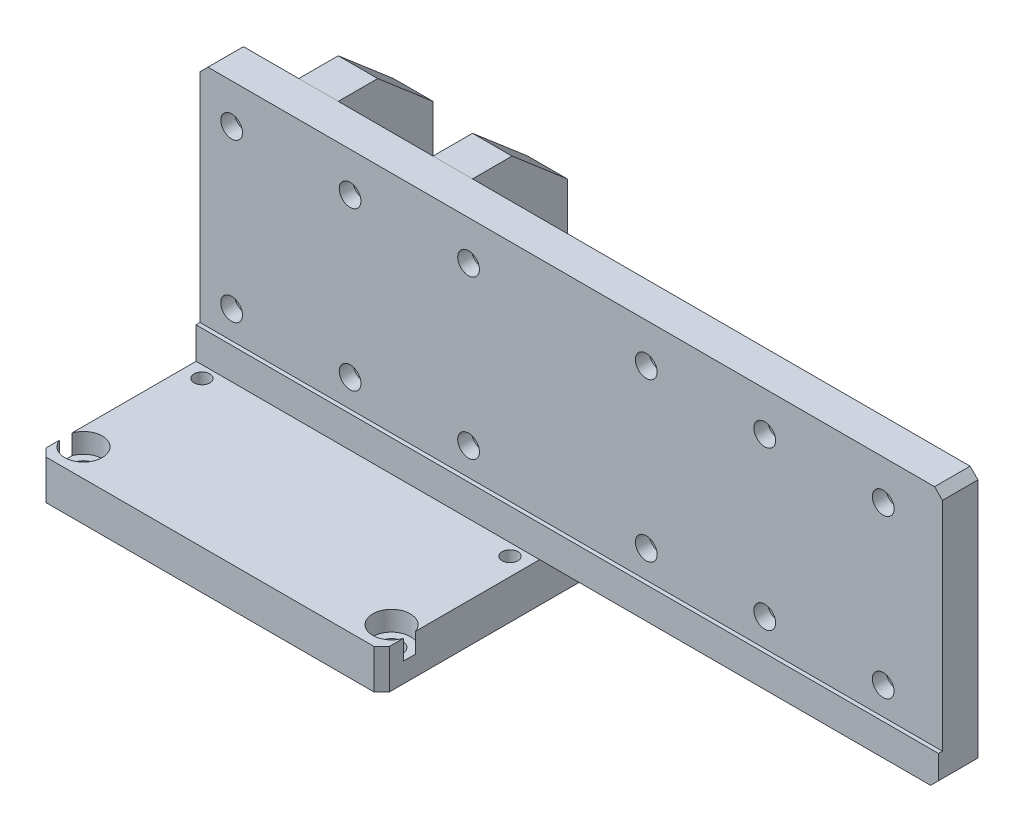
ISO-10303-21;
HEADER;
FILE_DESCRIPTION(('STEP AP214'),'2;1');
FILE_NAME('part.step','',(''),(''),'','','');
FILE_SCHEMA(('AUTOMOTIVE_DESIGN { 1 0 10303 214 1 1 1 1 }'));
ENDSEC;
DATA;
#1=APPLICATION_CONTEXT('core data for automotive mechanical design processes');
#2=APPLICATION_PROTOCOL_DEFINITION('international standard','automotive_design',2000,#1);
#3=PRODUCT_CONTEXT('',#1,'mechanical');
#4=PRODUCT('Part','Part','',(#3));
#5=PRODUCT_RELATED_PRODUCT_CATEGORY('part','',(#4));
#6=PRODUCT_DEFINITION_FORMATION('','',#4);
#7=PRODUCT_DEFINITION_CONTEXT('part definition',#1,'design');
#8=PRODUCT_DEFINITION('design','',#6,#7);
#9=PRODUCT_DEFINITION_SHAPE('','',#8);
#10=(LENGTH_UNIT() NAMED_UNIT(*) SI_UNIT(.MILLI.,.METRE.));
#11=(NAMED_UNIT(*) PLANE_ANGLE_UNIT() SI_UNIT($,.RADIAN.));
#12=(NAMED_UNIT(*) SI_UNIT($,.STERADIAN.) SOLID_ANGLE_UNIT());
#13=UNCERTAINTY_MEASURE_WITH_UNIT(LENGTH_MEASURE(1.E-05),#10,'distance_accuracy_value','');
#14=(GEOMETRIC_REPRESENTATION_CONTEXT(3) GLOBAL_UNCERTAINTY_ASSIGNED_CONTEXT((#13)) GLOBAL_UNIT_ASSIGNED_CONTEXT((#10,
#11,#12)) REPRESENTATION_CONTEXT('',''));
#15=CARTESIAN_POINT('',(0.,0.,0.));
#16=DIRECTION('',(0.,0.,1.));
#17=DIRECTION('',(1.,0.,0.));
#18=AXIS2_PLACEMENT_3D('',#15,#16,#17);
#19=CARTESIAN_POINT('',(6.5,75.,-37.));
#20=DIRECTION('',(1.,0.,0.));
#21=DIRECTION('',(0.,0.,-1.));
#22=AXIS2_PLACEMENT_3D('',#19,#20,#21);
#23=PLANE('',#22);
#24=DIRECTION('',(0.,0.,1.));
#25=VECTOR('',#24,1.);
#26=CARTESIAN_POINT('',(6.5,75.,-37.));
#27=LINE('',#26,#25);
#28=CARTESIAN_POINT('',(6.5,75.,-23.));
#29=VERTEX_POINT('',#28);
#30=CARTESIAN_POINT('',(6.5,75.,-13.));
#31=VERTEX_POINT('',#30);
#32=EDGE_CURVE('E105',#29,#31,#27,.T.);
#33=ORIENTED_EDGE('',*,*,#32,.F.);
#34=DIRECTION('',(0.,-0.650791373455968,-0.759256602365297));
#35=VECTOR('',#34,1.);
#36=CARTESIAN_POINT('',(6.5,68.0823529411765,-31.0705882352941));
#37=LINE('',#36,#35);
#38=CARTESIAN_POINT('',(6.5,63.,-37.));
#39=VERTEX_POINT('',#38);
#40=EDGE_CURVE('E59',#29,#39,#37,.T.);
#41=ORIENTED_EDGE('',*,*,#40,.T.);
#42=DIRECTION('',(0.,-1.,0.));
#43=VECTOR('',#42,1.);
#44=CARTESIAN_POINT('',(6.5,75.,-37.));
#45=LINE('',#44,#43);
#46=CARTESIAN_POINT('',(6.5,10.,-37.));
#47=VERTEX_POINT('',#46);
#48=EDGE_CURVE('E87',#39,#47,#45,.T.);
#49=ORIENTED_EDGE('',*,*,#48,.T.);
#50=DIRECTION('',(0.,0.,1.));
#51=VECTOR('',#50,1.);
#52=CARTESIAN_POINT('',(6.5,10.,-37.));
#53=LINE('',#52,#51);
#54=CARTESIAN_POINT('',(6.5,10.,-13.));
#55=VERTEX_POINT('',#54);
#56=EDGE_CURVE('E92',#47,#55,#53,.T.);
#57=ORIENTED_EDGE('',*,*,#56,.T.);
#58=DIRECTION('',(0.,-1.,0.));
#59=VECTOR('',#58,1.);
#60=CARTESIAN_POINT('',(6.5,75.,-13.));
#61=LINE('',#60,#59);
#62=EDGE_CURVE('E53',#31,#55,#61,.T.);
#63=ORIENTED_EDGE('',*,*,#62,.F.);
#64=EDGE_LOOP('',(#33,#41,#49,#57,#63));
#65=FACE_BOUND('',#64,.T.);
#66=ADVANCED_FACE('F46',(#65),#23,.F.);
#67=CARTESIAN_POINT('',(6.5,75.,-13.));
#68=DIRECTION('',(0.,0.,-1.));
#69=DIRECTION('',(-1.,0.,0.));
#70=AXIS2_PLACEMENT_3D('',#67,#68,#69);
#71=PLANE('',#70);
#72=DIRECTION('',(1.,0.,0.));
#73=VECTOR('',#72,1.);
#74=CARTESIAN_POINT('',(6.5,10.,-13.));
#75=LINE('',#74,#73);
#76=CARTESIAN_POINT('',(16.5,10.,-13.));
#77=VERTEX_POINT('',#76);
#78=EDGE_CURVE('E109',#55,#77,#75,.T.);
#79=ORIENTED_EDGE('',*,*,#78,.T.);
#80=DIRECTION('',(0.,-1.,0.));
#81=VECTOR('',#80,1.);
#82=CARTESIAN_POINT('',(16.5,75.,-13.));
#83=LINE('',#82,#81);
#84=CARTESIAN_POINT('',(16.5,75.,-13.));
#85=VERTEX_POINT('',#84);
#86=EDGE_CURVE('E120',#85,#77,#83,.T.);
#87=ORIENTED_EDGE('',*,*,#86,.F.);
#88=DIRECTION('',(1.,0.,0.));
#89=VECTOR('',#88,1.);
#90=CARTESIAN_POINT('',(6.5,75.,-13.));
#91=LINE('',#90,#89);
#92=EDGE_CURVE('E68',#31,#85,#91,.T.);
#93=ORIENTED_EDGE('',*,*,#92,.F.);
#94=ORIENTED_EDGE('',*,*,#62,.T.);
#95=EDGE_LOOP('',(#79,#87,#93,#94));
#96=FACE_BOUND('',#95,.T.);
#97=ADVANCED_FACE('F123',(#96),#71,.F.);
#98=CARTESIAN_POINT('',(16.5,75.,-37.));
#99=DIRECTION('',(-1.,0.,0.));
#100=DIRECTION('',(0.,0.,1.));
#101=AXIS2_PLACEMENT_3D('',#98,#99,#100);
#102=PLANE('',#101);
#103=DIRECTION('',(0.,-1.,0.));
#104=VECTOR('',#103,1.);
#105=CARTESIAN_POINT('',(16.5,75.,-37.));
#106=LINE('',#105,#104);
#107=CARTESIAN_POINT('',(16.5,63.,-37.));
#108=VERTEX_POINT('',#107);
#109=CARTESIAN_POINT('',(16.5,10.,-37.));
#110=VERTEX_POINT('',#109);
#111=EDGE_CURVE('E95',#108,#110,#106,.T.);
#112=ORIENTED_EDGE('',*,*,#111,.F.);
#113=DIRECTION('',(0.,-0.650791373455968,-0.759256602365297));
#114=VECTOR('',#113,1.);
#115=CARTESIAN_POINT('',(16.5,75.,-23.));
#116=LINE('',#115,#114);
#117=CARTESIAN_POINT('',(16.5,75.,-23.));
#118=VERTEX_POINT('',#117);
#119=EDGE_CURVE('E127',#118,#108,#116,.T.);
#120=ORIENTED_EDGE('',*,*,#119,.F.);
#121=DIRECTION('',(0.,0.,-1.));
#122=VECTOR('',#121,1.);
#123=CARTESIAN_POINT('',(16.5,75.,-37.));
#124=LINE('',#123,#122);
#125=EDGE_CURVE('E96',#85,#118,#124,.T.);
#126=ORIENTED_EDGE('',*,*,#125,.F.);
#127=ORIENTED_EDGE('',*,*,#86,.T.);
#128=DIRECTION('',(0.,0.,-1.));
#129=VECTOR('',#128,1.);
#130=CARTESIAN_POINT('',(16.5,10.,-37.));
#131=LINE('',#130,#129);
#132=EDGE_CURVE('E106',#77,#110,#131,.T.);
#133=ORIENTED_EDGE('',*,*,#132,.T.);
#134=EDGE_LOOP('',(#112,#120,#126,#127,#133));
#135=FACE_BOUND('',#134,.T.);
#136=ADVANCED_FACE('F136',(#135),#102,.F.);
#137=CARTESIAN_POINT('',(6.5,75.,-37.));
#138=DIRECTION('',(0.,0.,1.));
#139=DIRECTION('',(1.,0.,0.));
#140=AXIS2_PLACEMENT_3D('',#137,#138,#139);
#141=PLANE('',#140);
#142=ORIENTED_EDGE('',*,*,#48,.F.);
#143=DIRECTION('',(1.,0.,0.));
#144=VECTOR('',#143,1.);
#145=CARTESIAN_POINT('',(-43.5,63.,-37.));
#146=LINE('',#145,#144);
#147=EDGE_CURVE('E113',#39,#108,#146,.T.);
#148=ORIENTED_EDGE('',*,*,#147,.T.);
#149=ORIENTED_EDGE('',*,*,#111,.T.);
#150=DIRECTION('',(-1.,0.,0.));
#151=VECTOR('',#150,1.);
#152=CARTESIAN_POINT('',(6.5,10.,-37.));
#153=LINE('',#152,#151);
#154=EDGE_CURVE('E99',#110,#47,#153,.T.);
#155=ORIENTED_EDGE('',*,*,#154,.T.);
#156=EDGE_LOOP('',(#142,#148,#149,#155));
#157=FACE_BOUND('',#156,.T.);
#158=ADVANCED_FACE('F100',(#157),#141,.F.);
#159=CARTESIAN_POINT('',(0.,75.,0.));
#160=DIRECTION('',(0.,1.,0.));
#161=DIRECTION('',(0.,0.,1.));
#162=AXIS2_PLACEMENT_3D('',#159,#160,#161);
#163=PLANE('',#162);
#164=DIRECTION('',(1.,0.,0.));
#165=VECTOR('',#164,1.);
#166=CARTESIAN_POINT('',(0.,75.,-23.));
#167=LINE('',#166,#165);
#168=EDGE_CURVE('E12',#29,#118,#167,.T.);
#169=ORIENTED_EDGE('',*,*,#168,.F.);
#170=ORIENTED_EDGE('',*,*,#32,.T.);
#171=ORIENTED_EDGE('',*,*,#92,.T.);
#172=ORIENTED_EDGE('',*,*,#125,.T.);
#173=EDGE_LOOP('',(#169,#170,#171,#172));
#174=FACE_BOUND('',#173,.T.);
#175=ADVANCED_FACE('F137',(#174),#163,.T.);
#176=CARTESIAN_POINT('',(0.,10.,0.));
#177=DIRECTION('',(0.,1.,0.));
#178=DIRECTION('',(0.,0.,1.));
#179=AXIS2_PLACEMENT_3D('',#176,#177,#178);
#180=PLANE('',#179);
#181=ORIENTED_EDGE('',*,*,#56,.F.);
#182=ORIENTED_EDGE('',*,*,#154,.F.);
#183=ORIENTED_EDGE('',*,*,#132,.F.);
#184=ORIENTED_EDGE('',*,*,#78,.F.);
#185=EDGE_LOOP('',(#181,#182,#183,#184));
#186=FACE_BOUND('',#185,.T.);
#187=ADVANCED_FACE('F108',(#186),#180,.F.);
#188=CARTESIAN_POINT('',(-43.5,75.,-23.));
#189=DIRECTION('',(0.,-0.759256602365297,0.650791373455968));
#190=DIRECTION('',(0.,-0.650791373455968,-0.759256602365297));
#191=AXIS2_PLACEMENT_3D('',#188,#189,#190);
#192=PLANE('',#191);
#193=ORIENTED_EDGE('',*,*,#168,.T.);
#194=ORIENTED_EDGE('',*,*,#119,.T.);
#195=ORIENTED_EDGE('',*,*,#147,.F.);
#196=ORIENTED_EDGE('',*,*,#40,.F.);
#197=EDGE_LOOP('',(#193,#194,#195,#196));
#198=FACE_BOUND('',#197,.T.);
#199=ADVANCED_FACE('F131',(#198),#192,.F.);
#200=CLOSED_SHELL('',(#66,#97,#136,#158,#175,#187,#199));
#201=MANIFOLD_SOLID_BREP('B2',#200);
#202=CARTESIAN_POINT('',(-27.5,75.,-37.));
#203=DIRECTION('',(1.,0.,0.));
#204=DIRECTION('',(0.,0.,-1.));
#205=AXIS2_PLACEMENT_3D('',#202,#203,#204);
#206=PLANE('',#205);
#207=DIRECTION('',(0.,0.,1.));
#208=VECTOR('',#207,1.);
#209=CARTESIAN_POINT('',(-27.5,75.,-37.));
#210=LINE('',#209,#208);
#211=CARTESIAN_POINT('',(-27.5,75.,-23.));
#212=VERTEX_POINT('',#211);
#213=CARTESIAN_POINT('',(-27.5,75.,-13.));
#214=VERTEX_POINT('',#213);
#215=EDGE_CURVE('E266',#212,#214,#210,.T.);
#216=ORIENTED_EDGE('',*,*,#215,.F.);
#217=DIRECTION('',(0.,-0.650791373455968,-0.759256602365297));
#218=VECTOR('',#217,1.);
#219=CARTESIAN_POINT('',(-27.5,68.0823529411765,-31.0705882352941));
#220=LINE('',#219,#218);
#221=CARTESIAN_POINT('',(-27.5,63.,-37.));
#222=VERTEX_POINT('',#221);
#223=EDGE_CURVE('E219',#212,#222,#220,.T.);
#224=ORIENTED_EDGE('',*,*,#223,.T.);
#225=DIRECTION('',(0.,-1.,0.));
#226=VECTOR('',#225,1.);
#227=CARTESIAN_POINT('',(-27.5,75.,-37.));
#228=LINE('',#227,#226);
#229=CARTESIAN_POINT('',(-27.5,10.,-37.));
#230=VERTEX_POINT('',#229);
#231=EDGE_CURVE('E247',#222,#230,#228,.T.);
#232=ORIENTED_EDGE('',*,*,#231,.T.);
#233=DIRECTION('',(0.,0.,1.));
#234=VECTOR('',#233,1.);
#235=CARTESIAN_POINT('',(-27.5,10.,-37.));
#236=LINE('',#235,#234);
#237=CARTESIAN_POINT('',(-27.5,10.,-13.));
#238=VERTEX_POINT('',#237);
#239=EDGE_CURVE('E252',#230,#238,#236,.T.);
#240=ORIENTED_EDGE('',*,*,#239,.T.);
#241=DIRECTION('',(0.,-1.,0.));
#242=VECTOR('',#241,1.);
#243=CARTESIAN_POINT('',(-27.5,75.,-13.));
#244=LINE('',#243,#242);
#245=EDGE_CURVE('E213',#214,#238,#244,.T.);
#246=ORIENTED_EDGE('',*,*,#245,.F.);
#247=EDGE_LOOP('',(#216,#224,#232,#240,#246));
#248=FACE_BOUND('',#247,.T.);
#249=ADVANCED_FACE('F206',(#248),#206,.F.);
#250=CARTESIAN_POINT('',(-27.5,75.,-13.));
#251=DIRECTION('',(0.,0.,-1.));
#252=DIRECTION('',(-1.,0.,0.));
#253=AXIS2_PLACEMENT_3D('',#250,#251,#252);
#254=PLANE('',#253);
#255=DIRECTION('',(1.,0.,0.));
#256=VECTOR('',#255,1.);
#257=CARTESIAN_POINT('',(-27.5,10.,-13.));
#258=LINE('',#257,#256);
#259=CARTESIAN_POINT('',(-17.5,10.,-13.));
#260=VERTEX_POINT('',#259);
#261=EDGE_CURVE('E270',#238,#260,#258,.T.);
#262=ORIENTED_EDGE('',*,*,#261,.T.);
#263=DIRECTION('',(0.,-1.,0.));
#264=VECTOR('',#263,1.);
#265=CARTESIAN_POINT('',(-17.5,75.,-13.));
#266=LINE('',#265,#264);
#267=CARTESIAN_POINT('',(-17.5,75.,-13.));
#268=VERTEX_POINT('',#267);
#269=EDGE_CURVE('E281',#268,#260,#266,.T.);
#270=ORIENTED_EDGE('',*,*,#269,.F.);
#271=DIRECTION('',(1.,0.,0.));
#272=VECTOR('',#271,1.);
#273=CARTESIAN_POINT('',(-27.5,75.,-13.));
#274=LINE('',#273,#272);
#275=EDGE_CURVE('E228',#214,#268,#274,.T.);
#276=ORIENTED_EDGE('',*,*,#275,.F.);
#277=ORIENTED_EDGE('',*,*,#245,.T.);
#278=EDGE_LOOP('',(#262,#270,#276,#277));
#279=FACE_BOUND('',#278,.T.);
#280=ADVANCED_FACE('F284',(#279),#254,.F.);
#281=CARTESIAN_POINT('',(-17.5,75.,-37.));
#282=DIRECTION('',(-1.,0.,0.));
#283=DIRECTION('',(0.,0.,1.));
#284=AXIS2_PLACEMENT_3D('',#281,#282,#283);
#285=PLANE('',#284);
#286=DIRECTION('',(0.,-1.,0.));
#287=VECTOR('',#286,1.);
#288=CARTESIAN_POINT('',(-17.5,75.,-37.));
#289=LINE('',#288,#287);
#290=CARTESIAN_POINT('',(-17.5,63.,-37.));
#291=VERTEX_POINT('',#290);
#292=CARTESIAN_POINT('',(-17.5,10.,-37.));
#293=VERTEX_POINT('',#292);
#294=EDGE_CURVE('E256',#291,#293,#289,.T.);
#295=ORIENTED_EDGE('',*,*,#294,.F.);
#296=DIRECTION('',(0.,0.650791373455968,0.759256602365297));
#297=VECTOR('',#296,1.);
#298=CARTESIAN_POINT('',(-17.5,68.0823529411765,-31.0705882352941));
#299=LINE('',#298,#297);
#300=CARTESIAN_POINT('',(-17.5,75.,-23.));
#301=VERTEX_POINT('',#300);
#302=EDGE_CURVE('E274',#291,#301,#299,.T.);
#303=ORIENTED_EDGE('',*,*,#302,.T.);
#304=DIRECTION('',(0.,0.,-1.));
#305=VECTOR('',#304,1.);
#306=CARTESIAN_POINT('',(-17.5,75.,-37.));
#307=LINE('',#306,#305);
#308=EDGE_CURVE('E257',#268,#301,#307,.T.);
#309=ORIENTED_EDGE('',*,*,#308,.F.);
#310=ORIENTED_EDGE('',*,*,#269,.T.);
#311=DIRECTION('',(0.,0.,-1.));
#312=VECTOR('',#311,1.);
#313=CARTESIAN_POINT('',(-17.5,10.,-37.));
#314=LINE('',#313,#312);
#315=EDGE_CURVE('E267',#260,#293,#314,.T.);
#316=ORIENTED_EDGE('',*,*,#315,.T.);
#317=EDGE_LOOP('',(#295,#303,#309,#310,#316));
#318=FACE_BOUND('',#317,.T.);
#319=ADVANCED_FACE('F292',(#318),#285,.F.);
#320=CARTESIAN_POINT('',(-27.5,75.,-37.));
#321=DIRECTION('',(0.,0.,1.));
#322=DIRECTION('',(1.,0.,0.));
#323=AXIS2_PLACEMENT_3D('',#320,#321,#322);
#324=PLANE('',#323);
#325=ORIENTED_EDGE('',*,*,#231,.F.);
#326=DIRECTION('',(1.,0.,0.));
#327=VECTOR('',#326,1.);
#328=CARTESIAN_POINT('',(-43.5,63.,-37.));
#329=LINE('',#328,#327);
#330=EDGE_CURVE('E289',#222,#291,#329,.T.);
#331=ORIENTED_EDGE('',*,*,#330,.T.);
#332=ORIENTED_EDGE('',*,*,#294,.T.);
#333=DIRECTION('',(-1.,0.,0.));
#334=VECTOR('',#333,1.);
#335=CARTESIAN_POINT('',(-27.5,10.,-37.));
#336=LINE('',#335,#334);
#337=EDGE_CURVE('E260',#293,#230,#336,.T.);
#338=ORIENTED_EDGE('',*,*,#337,.T.);
#339=EDGE_LOOP('',(#325,#331,#332,#338));
#340=FACE_BOUND('',#339,.T.);
#341=ADVANCED_FACE('F261',(#340),#324,.F.);
#342=CARTESIAN_POINT('',(0.,75.,0.));
#343=DIRECTION('',(0.,1.,0.));
#344=DIRECTION('',(0.,0.,1.));
#345=AXIS2_PLACEMENT_3D('',#342,#343,#344);
#346=PLANE('',#345);
#347=DIRECTION('',(1.,0.,0.));
#348=VECTOR('',#347,1.);
#349=CARTESIAN_POINT('',(0.,75.,-23.));
#350=LINE('',#349,#348);
#351=EDGE_CURVE('E44',#212,#301,#350,.T.);
#352=ORIENTED_EDGE('',*,*,#351,.F.);
#353=ORIENTED_EDGE('',*,*,#215,.T.);
#354=ORIENTED_EDGE('',*,*,#275,.T.);
#355=ORIENTED_EDGE('',*,*,#308,.T.);
#356=EDGE_LOOP('',(#352,#353,#354,#355));
#357=FACE_BOUND('',#356,.T.);
#358=ADVANCED_FACE('F295',(#357),#346,.T.);
#359=CARTESIAN_POINT('',(0.,10.,0.));
#360=DIRECTION('',(0.,1.,0.));
#361=DIRECTION('',(0.,0.,1.));
#362=AXIS2_PLACEMENT_3D('',#359,#360,#361);
#363=PLANE('',#362);
#364=ORIENTED_EDGE('',*,*,#239,.F.);
#365=ORIENTED_EDGE('',*,*,#337,.F.);
#366=ORIENTED_EDGE('',*,*,#315,.F.);
#367=ORIENTED_EDGE('',*,*,#261,.F.);
#368=EDGE_LOOP('',(#364,#365,#366,#367));
#369=FACE_BOUND('',#368,.T.);
#370=ADVANCED_FACE('F269',(#369),#363,.F.);
#371=CARTESIAN_POINT('',(-43.5,75.,-23.));
#372=DIRECTION('',(0.,-0.759256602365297,0.650791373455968));
#373=DIRECTION('',(0.,-0.650791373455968,-0.759256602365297));
#374=AXIS2_PLACEMENT_3D('',#371,#372,#373);
#375=PLANE('',#374);
#376=ORIENTED_EDGE('',*,*,#351,.T.);
#377=ORIENTED_EDGE('',*,*,#302,.F.);
#378=ORIENTED_EDGE('',*,*,#330,.F.);
#379=ORIENTED_EDGE('',*,*,#223,.F.);
#380=EDGE_LOOP('',(#376,#377,#378,#379));
#381=FACE_BOUND('',#380,.T.);
#382=ADVANCED_FACE('F298',(#381),#375,.F.);
#383=CLOSED_SHELL('',(#249,#280,#319,#341,#358,#370,#382));
#384=MANIFOLD_SOLID_BREP('B6',#383);
#385=CARTESIAN_POINT('',(0.,75.,0.));
#386=DIRECTION('',(0.,1.,0.));
#387=DIRECTION('',(0.,0.,1.));
#388=AXIS2_PLACEMENT_3D('',#385,#386,#387);
#389=PLANE('',#388);
#390=DIRECTION('',(-1.,0.,0.));
#391=VECTOR('',#390,1.);
#392=CARTESIAN_POINT('',(-43.5,75.,-4.));
#393=LINE('',#392,#391);
#394=CARTESIAN_POINT('',(142.5,75.,-4.));
#395=VERTEX_POINT('',#394);
#396=CARTESIAN_POINT('',(-41.5,75.,-4.));
#397=VERTEX_POINT('',#396);
#398=EDGE_CURVE('E455',#395,#397,#393,.T.);
#399=ORIENTED_EDGE('',*,*,#398,.F.);
#400=DIRECTION('',(0.,0.,-1.));
#401=VECTOR('',#400,1.);
#402=CARTESIAN_POINT('',(142.5,75.,-13.));
#403=LINE('',#402,#401);
#404=CARTESIAN_POINT('',(142.5,75.,-13.));
#405=VERTEX_POINT('',#404);
#406=EDGE_CURVE('E527',#395,#405,#403,.T.);
#407=ORIENTED_EDGE('',*,*,#406,.T.);
#408=DIRECTION('',(-1.,0.,0.));
#409=VECTOR('',#408,1.);
#410=CARTESIAN_POINT('',(-43.5,75.,-13.));
#411=LINE('',#410,#409);
#412=CARTESIAN_POINT('',(-41.5,75.,-13.));
#413=VERTEX_POINT('',#412);
#414=EDGE_CURVE('E462',#405,#413,#411,.T.);
#415=ORIENTED_EDGE('',*,*,#414,.T.);
#416=DIRECTION('',(0.,0.,1.));
#417=VECTOR('',#416,1.);
#418=CARTESIAN_POINT('',(-41.5,75.,-4.));
#419=LINE('',#418,#417);
#420=EDGE_CURVE('E525',#413,#397,#419,.T.);
#421=ORIENTED_EDGE('',*,*,#420,.T.);
#422=EDGE_LOOP('',(#399,#407,#415,#421));
#423=FACE_BOUND('',#422,.T.);
#424=ADVANCED_FACE('F365',(#423),#389,.T.);
#425=CARTESIAN_POINT('',(-43.5,75.,-13.));
#426=DIRECTION('',(1.,0.,0.));
#427=DIRECTION('',(0.,0.,-1.));
#428=AXIS2_PLACEMENT_3D('',#425,#426,#427);
#429=PLANE('',#428);
#430=DIRECTION('',(0.,-1.,0.));
#431=VECTOR('',#430,1.);
#432=CARTESIAN_POINT('',(-43.5,75.,-4.));
#433=LINE('',#432,#431);
#434=CARTESIAN_POINT('',(-43.5,73.,-4.));
#435=VERTEX_POINT('',#434);
#436=CARTESIAN_POINT('',(-43.5,18.,-4.));
#437=VERTEX_POINT('',#436);
#438=EDGE_CURVE('E433',#435,#437,#433,.T.);
#439=ORIENTED_EDGE('',*,*,#438,.F.);
#440=DIRECTION('',(0.,0.,-1.));
#441=VECTOR('',#440,1.);
#442=CARTESIAN_POINT('',(-43.5,73.,-13.));
#443=LINE('',#442,#441);
#444=CARTESIAN_POINT('',(-43.5,73.,-13.));
#445=VERTEX_POINT('',#444);
#446=EDGE_CURVE('E204',#435,#445,#443,.T.);
#447=ORIENTED_EDGE('',*,*,#446,.T.);
#448=DIRECTION('',(0.,-1.,0.));
#449=VECTOR('',#448,1.);
#450=CARTESIAN_POINT('',(-43.5,75.,-13.));
#451=LINE('',#450,#449);
#452=CARTESIAN_POINT('',(-43.5,10.,-13.));
#453=VERTEX_POINT('',#452);
#454=EDGE_CURVE('E465',#445,#453,#451,.T.);
#455=ORIENTED_EDGE('',*,*,#454,.T.);
#456=DIRECTION('',(0.,0.,1.));
#457=VECTOR('',#456,1.);
#458=CARTESIAN_POINT('',(-43.5,10.,-13.));
#459=LINE('',#458,#457);
#460=CARTESIAN_POINT('',(-43.5,10.,-3.));
#461=VERTEX_POINT('',#460);
#462=EDGE_CURVE('E457',#453,#461,#459,.T.);
#463=ORIENTED_EDGE('',*,*,#462,.T.);
#464=DIRECTION('',(0.,-1.,0.));
#465=VECTOR('',#464,1.);
#466=CARTESIAN_POINT('',(-43.5,75.,-3.));
#467=LINE('',#466,#465);
#468=CARTESIAN_POINT('',(-43.5,18.,-3.));
#469=VERTEX_POINT('',#468);
#470=EDGE_CURVE('E454',#469,#461,#467,.T.);
#471=ORIENTED_EDGE('',*,*,#470,.F.);
#472=DIRECTION('',(0.,0.,1.));
#473=VECTOR('',#472,1.);
#474=CARTESIAN_POINT('',(-43.5,18.,-4.));
#475=LINE('',#474,#473);
#476=EDGE_CURVE('E445',#437,#469,#475,.T.);
#477=ORIENTED_EDGE('',*,*,#476,.F.);
#478=EDGE_LOOP('',(#439,#447,#455,#463,#471,#477));
#479=FACE_BOUND('',#478,.T.);
#480=ADVANCED_FACE('F452',(#479),#429,.F.);
#481=CARTESIAN_POINT('',(-43.5,75.,-3.));
#482=DIRECTION('',(0.,0.,-1.));
#483=DIRECTION('',(-1.,0.,0.));
#484=AXIS2_PLACEMENT_3D('',#481,#482,#483);
#485=PLANE('',#484);
#486=DIRECTION('',(1.,0.,0.));
#487=VECTOR('',#486,1.);
#488=CARTESIAN_POINT('',(-43.5,10.,-3.));
#489=LINE('',#488,#487);
#490=CARTESIAN_POINT('',(142.5,10.,-3.));
#491=VERTEX_POINT('',#490);
#492=EDGE_CURVE('E468',#461,#491,#489,.T.);
#493=ORIENTED_EDGE('',*,*,#492,.T.);
#494=DIRECTION('',(-0.707106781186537,-0.707106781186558,0.));
#495=VECTOR('',#494,1.);
#496=CARTESIAN_POINT('',(144.5,12.,-3.));
#497=LINE('',#496,#495);
#498=CARTESIAN_POINT('',(144.5,12.,-3.));
#499=VERTEX_POINT('',#498);
#500=EDGE_CURVE('E523',#491,#499,#497,.F.);
#501=ORIENTED_EDGE('',*,*,#500,.T.);
#502=DIRECTION('',(0.,-1.,0.));
#503=VECTOR('',#502,1.);
#504=CARTESIAN_POINT('',(144.5,75.,-3.));
#505=LINE('',#504,#503);
#506=CARTESIAN_POINT('',(144.5,18.,-3.));
#507=VERTEX_POINT('',#506);
#508=EDGE_CURVE('E477',#507,#499,#505,.T.);
#509=ORIENTED_EDGE('',*,*,#508,.F.);
#510=DIRECTION('',(1.,0.,0.));
#511=VECTOR('',#510,1.);
#512=CARTESIAN_POINT('',(-43.5,18.,-3.));
#513=LINE('',#512,#511);
#514=EDGE_CURVE('E441',#469,#507,#513,.T.);
#515=ORIENTED_EDGE('',*,*,#514,.F.);
#516=ORIENTED_EDGE('',*,*,#470,.T.);
#517=EDGE_LOOP('',(#493,#501,#509,#515,#516));
#518=FACE_BOUND('',#517,.T.);
#519=ADVANCED_FACE('F570',(#518),#485,.F.);
#520=CARTESIAN_POINT('',(144.5,75.,-13.));
#521=DIRECTION('',(-1.,0.,0.));
#522=DIRECTION('',(0.,0.,1.));
#523=AXIS2_PLACEMENT_3D('',#520,#521,#522);
#524=PLANE('',#523);
#525=ORIENTED_EDGE('',*,*,#508,.T.);
#526=DIRECTION('',(0.,0.,-1.));
#527=VECTOR('',#526,1.);
#528=CARTESIAN_POINT('',(144.5,12.,-13.));
#529=LINE('',#528,#527);
#530=CARTESIAN_POINT('',(144.5,12.,-13.));
#531=VERTEX_POINT('',#530);
#532=EDGE_CURVE('E512',#499,#531,#529,.T.);
#533=ORIENTED_EDGE('',*,*,#532,.T.);
#534=DIRECTION('',(0.,-1.,0.));
#535=VECTOR('',#534,1.);
#536=CARTESIAN_POINT('',(144.5,75.,-13.));
#537=LINE('',#536,#535);
#538=CARTESIAN_POINT('',(144.5,73.,-13.));
#539=VERTEX_POINT('',#538);
#540=EDGE_CURVE('E474',#539,#531,#537,.T.);
#541=ORIENTED_EDGE('',*,*,#540,.F.);
#542=DIRECTION('',(0.,0.,1.));
#543=VECTOR('',#542,1.);
#544=CARTESIAN_POINT('',(144.5,73.,-4.));
#545=LINE('',#544,#543);
#546=CARTESIAN_POINT('',(144.5,73.,-4.));
#547=VERTEX_POINT('',#546);
#548=EDGE_CURVE('E481',#539,#547,#545,.T.);
#549=ORIENTED_EDGE('',*,*,#548,.T.);
#550=DIRECTION('',(0.,1.,0.));
#551=VECTOR('',#550,1.);
#552=CARTESIAN_POINT('',(144.5,75.,-4.));
#553=LINE('',#552,#551);
#554=CARTESIAN_POINT('',(144.5,18.,-4.));
#555=VERTEX_POINT('',#554);
#556=EDGE_CURVE('E449',#555,#547,#553,.T.);
#557=ORIENTED_EDGE('',*,*,#556,.F.);
#558=DIRECTION('',(0.,0.,1.));
#559=VECTOR('',#558,1.);
#560=CARTESIAN_POINT('',(144.5,18.,-4.));
#561=LINE('',#560,#559);
#562=EDGE_CURVE('E448',#555,#507,#561,.T.);
#563=ORIENTED_EDGE('',*,*,#562,.T.);
#564=EDGE_LOOP('',(#525,#533,#541,#549,#557,#563));
#565=FACE_BOUND('',#564,.T.);
#566=ADVANCED_FACE('F542',(#565),#524,.F.);
#567=CARTESIAN_POINT('',(-43.5,75.,-13.));
#568=DIRECTION('',(0.,0.,1.));
#569=DIRECTION('',(1.,0.,0.));
#570=AXIS2_PLACEMENT_3D('',#567,#568,#569);
#571=PLANE('',#570);
#572=CARTESIAN_POINT('',(99.5,65.,-13.));
#573=DIRECTION('',(0.,0.,-1.));
#574=DIRECTION('',(-1.,0.,0.));
#575=AXIS2_PLACEMENT_3D('',#572,#573,#574);
#576=CIRCLE('',#575,4.75);
#577=CARTESIAN_POINT('',(94.75,65.,-13.));
#578=VERTEX_POINT('',#577);
#579=EDGE_CURVE('E809',#578,#578,#576,.T.);
#580=ORIENTED_EDGE('',*,*,#579,.F.);
#581=EDGE_LOOP('',(#580));
#582=FACE_BOUND('',#581,.T.);
#583=CARTESIAN_POINT('',(129.5,65.,-13.));
#584=DIRECTION('',(0.,0.,-1.));
#585=DIRECTION('',(-1.,0.,0.));
#586=AXIS2_PLACEMENT_3D('',#583,#584,#585);
#587=CIRCLE('',#586,4.75);
#588=CARTESIAN_POINT('',(124.75,65.,-13.));
#589=VERTEX_POINT('',#588);
#590=EDGE_CURVE('E799',#589,#589,#587,.T.);
#591=ORIENTED_EDGE('',*,*,#590,.F.);
#592=EDGE_LOOP('',(#591));
#593=FACE_BOUND('',#592,.T.);
#594=CARTESIAN_POINT('',(129.5,25.,-13.));
#595=DIRECTION('',(0.,0.,-1.));
#596=DIRECTION('',(-1.,0.,0.));
#597=AXIS2_PLACEMENT_3D('',#594,#595,#596);
#598=CIRCLE('',#597,4.75);
#599=CARTESIAN_POINT('',(124.75,25.,-13.));
#600=VERTEX_POINT('',#599);
#601=EDGE_CURVE('E789',#600,#600,#598,.T.);
#602=ORIENTED_EDGE('',*,*,#601,.F.);
#603=EDGE_LOOP('',(#602));
#604=FACE_BOUND('',#603,.T.);
#605=CARTESIAN_POINT('',(99.5,25.,-13.));
#606=DIRECTION('',(0.,0.,-1.));
#607=DIRECTION('',(-1.,0.,0.));
#608=AXIS2_PLACEMENT_3D('',#605,#606,#607);
#609=CIRCLE('',#608,4.75);
#610=CARTESIAN_POINT('',(94.75,25.,-13.));
#611=VERTEX_POINT('',#610);
#612=EDGE_CURVE('E779',#611,#611,#609,.T.);
#613=ORIENTED_EDGE('',*,*,#612,.F.);
#614=EDGE_LOOP('',(#613));
#615=FACE_BOUND('',#614,.T.);
#616=CARTESIAN_POINT('',(69.5,25.,-13.));
#617=DIRECTION('',(0.,0.,-1.));
#618=DIRECTION('',(-1.,0.,0.));
#619=AXIS2_PLACEMENT_3D('',#616,#617,#618);
#620=CIRCLE('',#619,4.75);
#621=CARTESIAN_POINT('',(64.75,25.,-13.));
#622=VERTEX_POINT('',#621);
#623=EDGE_CURVE('E769',#622,#622,#620,.T.);
#624=ORIENTED_EDGE('',*,*,#623,.F.);
#625=EDGE_LOOP('',(#624));
#626=FACE_BOUND('',#625,.T.);
#627=CARTESIAN_POINT('',(69.5,65.,-13.));
#628=DIRECTION('',(0.,0.,-1.));
#629=DIRECTION('',(-1.,0.,0.));
#630=AXIS2_PLACEMENT_3D('',#627,#628,#629);
#631=CIRCLE('',#630,4.75);
#632=CARTESIAN_POINT('',(64.75,65.,-13.));
#633=VERTEX_POINT('',#632);
#634=EDGE_CURVE('E759',#633,#633,#631,.T.);
#635=ORIENTED_EDGE('',*,*,#634,.F.);
#636=EDGE_LOOP('',(#635));
#637=FACE_BOUND('',#636,.T.);
#638=CARTESIAN_POINT('',(-35.5,65.,-13.));
#639=DIRECTION('',(0.,0.,-1.));
#640=DIRECTION('',(-1.,0.,0.));
#641=AXIS2_PLACEMENT_3D('',#638,#639,#640);
#642=CIRCLE('',#641,4.75);
#643=CARTESIAN_POINT('',(-40.25,65.,-13.));
#644=VERTEX_POINT('',#643);
#645=EDGE_CURVE('E749',#644,#644,#642,.T.);
#646=ORIENTED_EDGE('',*,*,#645,.F.);
#647=EDGE_LOOP('',(#646));
#648=FACE_BOUND('',#647,.T.);
#649=CARTESIAN_POINT('',(-5.50000000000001,65.,-13.));
#650=DIRECTION('',(0.,0.,-1.));
#651=DIRECTION('',(-1.,0.,0.));
#652=AXIS2_PLACEMENT_3D('',#649,#650,#651);
#653=CIRCLE('',#652,4.75);
#654=CARTESIAN_POINT('',(-10.25,65.,-13.));
#655=VERTEX_POINT('',#654);
#656=EDGE_CURVE('E509',#655,#655,#653,.T.);
#657=ORIENTED_EDGE('',*,*,#656,.F.);
#658=EDGE_LOOP('',(#657));
#659=FACE_BOUND('',#658,.T.);
#660=CARTESIAN_POINT('',(24.5,65.,-13.));
#661=DIRECTION('',(0.,0.,-1.));
#662=DIRECTION('',(-1.,0.,0.));
#663=AXIS2_PLACEMENT_3D('',#660,#661,#662);
#664=CIRCLE('',#663,4.75);
#665=CARTESIAN_POINT('',(19.75,65.,-13.));
#666=VERTEX_POINT('',#665);
#667=EDGE_CURVE('E504',#666,#666,#664,.T.);
#668=ORIENTED_EDGE('',*,*,#667,.F.);
#669=EDGE_LOOP('',(#668));
#670=FACE_BOUND('',#669,.T.);
#671=CARTESIAN_POINT('',(24.5,25.,-13.));
#672=DIRECTION('',(0.,0.,-1.));
#673=DIRECTION('',(-1.,0.,0.));
#674=AXIS2_PLACEMENT_3D('',#671,#672,#673);
#675=CIRCLE('',#674,4.75);
#676=CARTESIAN_POINT('',(19.75,25.,-13.));
#677=VERTEX_POINT('',#676);
#678=EDGE_CURVE('E499',#677,#677,#675,.T.);
#679=ORIENTED_EDGE('',*,*,#678,.F.);
#680=EDGE_LOOP('',(#679));
#681=FACE_BOUND('',#680,.T.);
#682=CARTESIAN_POINT('',(-5.50000000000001,25.,-13.));
#683=DIRECTION('',(0.,0.,-1.));
#684=DIRECTION('',(-1.,0.,0.));
#685=AXIS2_PLACEMENT_3D('',#682,#683,#684);
#686=CIRCLE('',#685,4.75);
#687=CARTESIAN_POINT('',(-10.25,25.,-13.));
#688=VERTEX_POINT('',#687);
#689=EDGE_CURVE('E494',#688,#688,#686,.T.);
#690=ORIENTED_EDGE('',*,*,#689,.F.);
#691=EDGE_LOOP('',(#690));
#692=FACE_BOUND('',#691,.T.);
#693=CARTESIAN_POINT('',(-35.5,25.,-13.));
#694=DIRECTION('',(0.,0.,-1.));
#695=DIRECTION('',(-1.,0.,0.));
#696=AXIS2_PLACEMENT_3D('',#693,#694,#695);
#697=CIRCLE('',#696,4.75);
#698=CARTESIAN_POINT('',(-40.25,25.,-13.));
#699=VERTEX_POINT('',#698);
#700=EDGE_CURVE('E489',#699,#699,#697,.T.);
#701=ORIENTED_EDGE('',*,*,#700,.F.);
#702=EDGE_LOOP('',(#701));
#703=FACE_BOUND('',#702,.T.);
#704=ORIENTED_EDGE('',*,*,#540,.T.);
#705=DIRECTION('',(0.707106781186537,0.707106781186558,0.));
#706=VECTOR('',#705,1.);
#707=CARTESIAN_POINT('',(144.5,12.,-13.));
#708=LINE('',#707,#706);
#709=CARTESIAN_POINT('',(142.5,10.,-13.));
#710=VERTEX_POINT('',#709);
#711=EDGE_CURVE('E519',#531,#710,#708,.F.);
#712=ORIENTED_EDGE('',*,*,#711,.T.);
#713=DIRECTION('',(-1.,0.,0.));
#714=VECTOR('',#713,1.);
#715=CARTESIAN_POINT('',(-43.5,10.,-13.));
#716=LINE('',#715,#714);
#717=EDGE_CURVE('E466',#710,#453,#716,.T.);
#718=ORIENTED_EDGE('',*,*,#717,.T.);
#719=ORIENTED_EDGE('',*,*,#454,.F.);
#720=DIRECTION('',(0.707106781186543,0.707106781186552,0.));
#721=VECTOR('',#720,1.);
#722=CARTESIAN_POINT('',(-41.5,75.,-13.));
#723=LINE('',#722,#721);
#724=EDGE_CURVE('E515',#445,#413,#723,.T.);
#725=ORIENTED_EDGE('',*,*,#724,.T.);
#726=ORIENTED_EDGE('',*,*,#414,.F.);
#727=DIRECTION('',(0.707106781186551,-0.707106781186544,0.));
#728=VECTOR('',#727,1.);
#729=CARTESIAN_POINT('',(142.5,75.,-13.));
#730=LINE('',#729,#728);
#731=EDGE_CURVE('E517',#405,#539,#730,.T.);
#732=ORIENTED_EDGE('',*,*,#731,.T.);
#733=EDGE_LOOP('',(#704,#712,#718,#719,#725,#726,#732));
#734=FACE_BOUND('',#733,.T.);
#735=ADVANCED_FACE('F540',(#582,#593,#604,#615,#626,#637,#648,#659,#670,#681,#692,#703,#734),
#571,.F.);
#736=CARTESIAN_POINT('',(0.,10.,0.));
#737=DIRECTION('',(0.,1.,0.));
#738=DIRECTION('',(0.,0.,1.));
#739=AXIS2_PLACEMENT_3D('',#736,#737,#738);
#740=PLANE('',#739);
#741=ORIENTED_EDGE('',*,*,#717,.F.);
#742=DIRECTION('',(0.,0.,1.));
#743=VECTOR('',#742,1.);
#744=CARTESIAN_POINT('',(142.5,10.,3.95516952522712E-13));
#745=LINE('',#744,#743);
#746=EDGE_CURVE('E521',#710,#491,#745,.T.);
#747=ORIENTED_EDGE('',*,*,#746,.T.);
#748=ORIENTED_EDGE('',*,*,#492,.F.);
#749=ORIENTED_EDGE('',*,*,#462,.F.);
#750=EDGE_LOOP('',(#741,#747,#748,#749));
#751=FACE_BOUND('',#750,.T.);
#752=ADVANCED_FACE('F553',(#751),#740,.F.);
#753=CARTESIAN_POINT('',(-43.5,18.,-4.));
#754=DIRECTION('',(0.,-1.,0.));
#755=DIRECTION('',(1.,0.,0.));
#756=AXIS2_PLACEMENT_3D('',#753,#754,#755);
#757=PLANE('',#756);
#758=ORIENTED_EDGE('',*,*,#514,.T.);
#759=ORIENTED_EDGE('',*,*,#562,.F.);
#760=DIRECTION('',(1.,0.,0.));
#761=VECTOR('',#760,1.);
#762=CARTESIAN_POINT('',(-43.5,18.,-4.));
#763=LINE('',#762,#761);
#764=EDGE_CURVE('E437',#437,#555,#763,.T.);
#765=ORIENTED_EDGE('',*,*,#764,.F.);
#766=ORIENTED_EDGE('',*,*,#476,.T.);
#767=EDGE_LOOP('',(#758,#759,#765,#766));
#768=FACE_BOUND('',#767,.T.);
#769=ADVANCED_FACE('F444',(#768),#757,.F.);
#770=CARTESIAN_POINT('',(0.,0.,-4.));
#771=DIRECTION('',(0.,0.,1.));
#772=DIRECTION('',(1.,0.,0.));
#773=AXIS2_PLACEMENT_3D('',#770,#771,#772);
#774=PLANE('',#773);
#775=CARTESIAN_POINT('',(99.5,65.,-4.));
#776=DIRECTION('',(0.,0.,1.));
#777=DIRECTION('',(1.,0.,0.));
#778=AXIS2_PLACEMENT_3D('',#775,#776,#777);
#779=CIRCLE('',#778,2.74999999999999);
#780=CARTESIAN_POINT('',(102.25,65.,-4.));
#781=VERTEX_POINT('',#780);
#782=EDGE_CURVE('E673',#781,#781,#779,.T.);
#783=ORIENTED_EDGE('',*,*,#782,.F.);
#784=EDGE_LOOP('',(#783));
#785=FACE_BOUND('',#784,.T.);
#786=CARTESIAN_POINT('',(129.5,65.,-4.));
#787=DIRECTION('',(0.,0.,1.));
#788=DIRECTION('',(1.,0.,0.));
#789=AXIS2_PLACEMENT_3D('',#786,#787,#788);
#790=CIRCLE('',#789,2.74999999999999);
#791=CARTESIAN_POINT('',(132.25,65.,-4.));
#792=VERTEX_POINT('',#791);
#793=EDGE_CURVE('E677',#792,#792,#790,.T.);
#794=ORIENTED_EDGE('',*,*,#793,.F.);
#795=EDGE_LOOP('',(#794));
#796=FACE_BOUND('',#795,.T.);
#797=CARTESIAN_POINT('',(129.5,25.,-4.));
#798=DIRECTION('',(0.,0.,1.));
#799=DIRECTION('',(1.,0.,0.));
#800=AXIS2_PLACEMENT_3D('',#797,#798,#799);
#801=CIRCLE('',#800,2.74999999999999);
#802=CARTESIAN_POINT('',(132.25,25.,-4.));
#803=VERTEX_POINT('',#802);
#804=EDGE_CURVE('E681',#803,#803,#801,.T.);
#805=ORIENTED_EDGE('',*,*,#804,.F.);
#806=EDGE_LOOP('',(#805));
#807=FACE_BOUND('',#806,.T.);
#808=CARTESIAN_POINT('',(99.5,25.,-4.));
#809=DIRECTION('',(0.,0.,1.));
#810=DIRECTION('',(1.,0.,0.));
#811=AXIS2_PLACEMENT_3D('',#808,#809,#810);
#812=CIRCLE('',#811,2.74999999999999);
#813=CARTESIAN_POINT('',(102.25,25.,-4.));
#814=VERTEX_POINT('',#813);
#815=EDGE_CURVE('E685',#814,#814,#812,.T.);
#816=ORIENTED_EDGE('',*,*,#815,.F.);
#817=EDGE_LOOP('',(#816));
#818=FACE_BOUND('',#817,.T.);
#819=CARTESIAN_POINT('',(69.5,25.,-4.));
#820=DIRECTION('',(0.,0.,1.));
#821=DIRECTION('',(1.,0.,0.));
#822=AXIS2_PLACEMENT_3D('',#819,#820,#821);
#823=CIRCLE('',#822,2.74999999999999);
#824=CARTESIAN_POINT('',(72.25,25.,-4.));
#825=VERTEX_POINT('',#824);
#826=EDGE_CURVE('E689',#825,#825,#823,.T.);
#827=ORIENTED_EDGE('',*,*,#826,.F.);
#828=EDGE_LOOP('',(#827));
#829=FACE_BOUND('',#828,.T.);
#830=CARTESIAN_POINT('',(69.5,65.,-4.));
#831=DIRECTION('',(0.,0.,1.));
#832=DIRECTION('',(1.,0.,0.));
#833=AXIS2_PLACEMENT_3D('',#830,#831,#832);
#834=CIRCLE('',#833,2.74999999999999);
#835=CARTESIAN_POINT('',(72.25,65.,-4.));
#836=VERTEX_POINT('',#835);
#837=EDGE_CURVE('E693',#836,#836,#834,.T.);
#838=ORIENTED_EDGE('',*,*,#837,.F.);
#839=EDGE_LOOP('',(#838));
#840=FACE_BOUND('',#839,.T.);
#841=CARTESIAN_POINT('',(-35.5,65.,-4.));
#842=DIRECTION('',(0.,0.,1.));
#843=DIRECTION('',(1.,0.,0.));
#844=AXIS2_PLACEMENT_3D('',#841,#842,#843);
#845=CIRCLE('',#844,2.74999999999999);
#846=CARTESIAN_POINT('',(-32.75,65.,-4.));
#847=VERTEX_POINT('',#846);
#848=EDGE_CURVE('E506',#847,#847,#845,.T.);
#849=ORIENTED_EDGE('',*,*,#848,.F.);
#850=EDGE_LOOP('',(#849));
#851=FACE_BOUND('',#850,.T.);
#852=CARTESIAN_POINT('',(-5.50000000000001,65.,-4.));
#853=DIRECTION('',(0.,0.,1.));
#854=DIRECTION('',(1.,0.,0.));
#855=AXIS2_PLACEMENT_3D('',#852,#853,#854);
#856=CIRCLE('',#855,2.74999999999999);
#857=CARTESIAN_POINT('',(-2.75000000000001,65.,-4.));
#858=VERTEX_POINT('',#857);
#859=EDGE_CURVE('E501',#858,#858,#856,.T.);
#860=ORIENTED_EDGE('',*,*,#859,.F.);
#861=EDGE_LOOP('',(#860));
#862=FACE_BOUND('',#861,.T.);
#863=CARTESIAN_POINT('',(24.5,65.,-4.));
#864=DIRECTION('',(0.,0.,1.));
#865=DIRECTION('',(1.,0.,0.));
#866=AXIS2_PLACEMENT_3D('',#863,#864,#865);
#867=CIRCLE('',#866,2.74999999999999);
#868=CARTESIAN_POINT('',(27.25,65.,-4.));
#869=VERTEX_POINT('',#868);
#870=EDGE_CURVE('E496',#869,#869,#867,.T.);
#871=ORIENTED_EDGE('',*,*,#870,.F.);
#872=EDGE_LOOP('',(#871));
#873=FACE_BOUND('',#872,.T.);
#874=CARTESIAN_POINT('',(24.5,25.,-4.));
#875=DIRECTION('',(0.,0.,1.));
#876=DIRECTION('',(1.,0.,0.));
#877=AXIS2_PLACEMENT_3D('',#874,#875,#876);
#878=CIRCLE('',#877,2.74999999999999);
#879=CARTESIAN_POINT('',(27.25,25.,-4.));
#880=VERTEX_POINT('',#879);
#881=EDGE_CURVE('E491',#880,#880,#878,.T.);
#882=ORIENTED_EDGE('',*,*,#881,.F.);
#883=EDGE_LOOP('',(#882));
#884=FACE_BOUND('',#883,.T.);
#885=CARTESIAN_POINT('',(-5.50000000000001,25.,-4.));
#886=DIRECTION('',(0.,0.,1.));
#887=DIRECTION('',(1.,0.,0.));
#888=AXIS2_PLACEMENT_3D('',#885,#886,#887);
#889=CIRCLE('',#888,2.74999999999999);
#890=CARTESIAN_POINT('',(-2.75000000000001,25.,-4.));
#891=VERTEX_POINT('',#890);
#892=EDGE_CURVE('E486',#891,#891,#889,.T.);
#893=ORIENTED_EDGE('',*,*,#892,.F.);
#894=EDGE_LOOP('',(#893));
#895=FACE_BOUND('',#894,.T.);
#896=CARTESIAN_POINT('',(-35.5,25.,-4.));
#897=DIRECTION('',(0.,0.,1.));
#898=DIRECTION('',(1.,0.,0.));
#899=AXIS2_PLACEMENT_3D('',#896,#897,#898);
#900=CIRCLE('',#899,2.74999999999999);
#901=CARTESIAN_POINT('',(-32.75,25.,-4.));
#902=VERTEX_POINT('',#901);
#903=EDGE_CURVE('E482',#902,#902,#900,.T.);
#904=ORIENTED_EDGE('',*,*,#903,.F.);
#905=EDGE_LOOP('',(#904));
#906=FACE_BOUND('',#905,.T.);
#907=ORIENTED_EDGE('',*,*,#556,.T.);
#908=DIRECTION('',(-0.707106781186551,0.707106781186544,0.));
#909=VECTOR('',#908,1.);
#910=CARTESIAN_POINT('',(108.749999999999,108.75,-4.));
#911=LINE('',#910,#909);
#912=EDGE_CURVE('E373',#547,#395,#911,.T.);
#913=ORIENTED_EDGE('',*,*,#912,.T.);
#914=ORIENTED_EDGE('',*,*,#398,.T.);
#915=DIRECTION('',(-0.707106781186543,-0.707106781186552,0.));
#916=VECTOR('',#915,1.);
#917=CARTESIAN_POINT('',(-58.2500000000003,58.2499999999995,-4.));
#918=LINE('',#917,#916);
#919=EDGE_CURVE('E380',#397,#435,#918,.T.);
#920=ORIENTED_EDGE('',*,*,#919,.T.);
#921=ORIENTED_EDGE('',*,*,#438,.T.);
#922=ORIENTED_EDGE('',*,*,#764,.T.);
#923=EDGE_LOOP('',(#907,#913,#914,#920,#921,#922));
#924=FACE_BOUND('',#923,.T.);
#925=ADVANCED_FACE('F436',(#785,#796,#807,#818,#829,#840,#851,#862,#873,#884,#895,#906,#924),
#774,.T.);
#926=CARTESIAN_POINT('',(-35.5,25.,-13.));
#927=DIRECTION('',(0.,0.,-1.));
#928=DIRECTION('',(-1.,0.,0.));
#929=AXIS2_PLACEMENT_3D('',#926,#927,#928);
#930=CYLINDRICAL_SURFACE('',#929,2.74999999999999);
#931=ORIENTED_EDGE('',*,*,#903,.T.);
#932=EDGE_LOOP('',(#931));
#933=FACE_BOUND('',#932,.T.);
#934=CARTESIAN_POINT('',(-35.5,25.,-7.5));
#935=DIRECTION('',(0.,0.,-1.));
#936=DIRECTION('',(-1.,0.,0.));
#937=AXIS2_PLACEMENT_3D('',#934,#935,#936);
#938=CIRCLE('',#937,2.75);
#939=CARTESIAN_POINT('',(-38.25,25.,-7.5));
#940=VERTEX_POINT('',#939);
#941=EDGE_CURVE('E485',#940,#940,#938,.T.);
#942=ORIENTED_EDGE('',*,*,#941,.T.);
#943=EDGE_LOOP('',(#942));
#944=FACE_BOUND('',#943,.T.);
#945=ADVANCED_FACE('F661',(#933,#944),#930,.F.);
#946=CARTESIAN_POINT('',(-32.75,25.,-7.5));
#947=DIRECTION('',(0.,0.,1.));
#948=DIRECTION('',(1.,0.,0.));
#949=AXIS2_PLACEMENT_3D('',#946,#947,#948);
#950=PLANE('',#949);
#951=ORIENTED_EDGE('',*,*,#941,.F.);
#952=EDGE_LOOP('',(#951));
#953=FACE_BOUND('',#952,.T.);
#954=CARTESIAN_POINT('',(-35.5,25.,-7.5));
#955=DIRECTION('',(0.,0.,-1.));
#956=DIRECTION('',(-1.,0.,0.));
#957=AXIS2_PLACEMENT_3D('',#954,#955,#956);
#958=CIRCLE('',#957,4.75);
#959=CARTESIAN_POINT('',(-40.25,25.,-7.5));
#960=VERTEX_POINT('',#959);
#961=EDGE_CURVE('E708',#960,#960,#958,.T.);
#962=ORIENTED_EDGE('',*,*,#961,.T.);
#963=EDGE_LOOP('',(#962));
#964=FACE_BOUND('',#963,.T.);
#965=ADVANCED_FACE('F657',(#953,#964),#950,.F.);
#966=CARTESIAN_POINT('',(-35.5,25.,-13.));
#967=DIRECTION('',(0.,0.,-1.));
#968=DIRECTION('',(-1.,0.,0.));
#969=AXIS2_PLACEMENT_3D('',#966,#967,#968);
#970=CYLINDRICAL_SURFACE('',#969,4.75);
#971=ORIENTED_EDGE('',*,*,#961,.F.);
#972=EDGE_LOOP('',(#971));
#973=FACE_BOUND('',#972,.T.);
#974=ORIENTED_EDGE('',*,*,#700,.T.);
#975=EDGE_LOOP('',(#974));
#976=FACE_BOUND('',#975,.T.);
#977=ADVANCED_FACE('F653',(#973,#976),#970,.F.);
#978=CARTESIAN_POINT('',(-5.50000000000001,25.,-13.));
#979=DIRECTION('',(0.,0.,-1.));
#980=DIRECTION('',(-1.,0.,0.));
#981=AXIS2_PLACEMENT_3D('',#978,#979,#980);
#982=CYLINDRICAL_SURFACE('',#981,2.74999999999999);
#983=ORIENTED_EDGE('',*,*,#892,.T.);
#984=EDGE_LOOP('',(#983));
#985=FACE_BOUND('',#984,.T.);
#986=CARTESIAN_POINT('',(-5.50000000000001,25.,-7.5));
#987=DIRECTION('',(0.,0.,-1.));
#988=DIRECTION('',(-1.,0.,0.));
#989=AXIS2_PLACEMENT_3D('',#986,#987,#988);
#990=CIRCLE('',#989,2.75);
#991=CARTESIAN_POINT('',(-8.25000000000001,25.,-7.5));
#992=VERTEX_POINT('',#991);
#993=EDGE_CURVE('E490',#992,#992,#990,.T.);
#994=ORIENTED_EDGE('',*,*,#993,.T.);
#995=EDGE_LOOP('',(#994));
#996=FACE_BOUND('',#995,.T.);
#997=ADVANCED_FACE('F649',(#985,#996),#982,.F.);
#998=CARTESIAN_POINT('',(-2.75,25.,-7.5));
#999=DIRECTION('',(0.,0.,1.));
#1000=DIRECTION('',(1.,0.,0.));
#1001=AXIS2_PLACEMENT_3D('',#998,#999,#1000);
#1002=PLANE('',#1001);
#1003=ORIENTED_EDGE('',*,*,#993,.F.);
#1004=EDGE_LOOP('',(#1003));
#1005=FACE_BOUND('',#1004,.T.);
#1006=CARTESIAN_POINT('',(-5.50000000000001,25.,-7.5));
#1007=DIRECTION('',(0.,0.,-1.));
#1008=DIRECTION('',(-1.,0.,0.));
#1009=AXIS2_PLACEMENT_3D('',#1006,#1007,#1008);
#1010=CIRCLE('',#1009,4.75);
#1011=CARTESIAN_POINT('',(-10.25,25.,-7.5));
#1012=VERTEX_POINT('',#1011);
#1013=EDGE_CURVE('E718',#1012,#1012,#1010,.T.);
#1014=ORIENTED_EDGE('',*,*,#1013,.T.);
#1015=EDGE_LOOP('',(#1014));
#1016=FACE_BOUND('',#1015,.T.);
#1017=ADVANCED_FACE('F645',(#1005,#1016),#1002,.F.);
#1018=CARTESIAN_POINT('',(-5.50000000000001,25.,-13.));
#1019=DIRECTION('',(0.,0.,-1.));
#1020=DIRECTION('',(-1.,0.,0.));
#1021=AXIS2_PLACEMENT_3D('',#1018,#1019,#1020);
#1022=CYLINDRICAL_SURFACE('',#1021,4.75);
#1023=ORIENTED_EDGE('',*,*,#1013,.F.);
#1024=EDGE_LOOP('',(#1023));
#1025=FACE_BOUND('',#1024,.T.);
#1026=ORIENTED_EDGE('',*,*,#689,.T.);
#1027=EDGE_LOOP('',(#1026));
#1028=FACE_BOUND('',#1027,.T.);
#1029=ADVANCED_FACE('F641',(#1025,#1028),#1022,.F.);
#1030=CARTESIAN_POINT('',(24.5,25.,-13.));
#1031=DIRECTION('',(0.,0.,-1.));
#1032=DIRECTION('',(-1.,0.,0.));
#1033=AXIS2_PLACEMENT_3D('',#1030,#1031,#1032);
#1034=CYLINDRICAL_SURFACE('',#1033,2.74999999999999);
#1035=ORIENTED_EDGE('',*,*,#881,.T.);
#1036=EDGE_LOOP('',(#1035));
#1037=FACE_BOUND('',#1036,.T.);
#1038=CARTESIAN_POINT('',(24.5,25.,-7.5));
#1039=DIRECTION('',(0.,0.,-1.));
#1040=DIRECTION('',(-1.,0.,0.));
#1041=AXIS2_PLACEMENT_3D('',#1038,#1039,#1040);
#1042=CIRCLE('',#1041,2.75000000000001);
#1043=CARTESIAN_POINT('',(21.75,25.,-7.5));
#1044=VERTEX_POINT('',#1043);
#1045=EDGE_CURVE('E495',#1044,#1044,#1042,.T.);
#1046=ORIENTED_EDGE('',*,*,#1045,.T.);
#1047=EDGE_LOOP('',(#1046));
#1048=FACE_BOUND('',#1047,.T.);
#1049=ADVANCED_FACE('F637',(#1037,#1048),#1034,.F.);
#1050=CARTESIAN_POINT('',(27.25,25.,-7.5));
#1051=DIRECTION('',(0.,0.,1.));
#1052=DIRECTION('',(1.,0.,0.));
#1053=AXIS2_PLACEMENT_3D('',#1050,#1051,#1052);
#1054=PLANE('',#1053);
#1055=ORIENTED_EDGE('',*,*,#1045,.F.);
#1056=EDGE_LOOP('',(#1055));
#1057=FACE_BOUND('',#1056,.T.);
#1058=CARTESIAN_POINT('',(24.5,25.,-7.5));
#1059=DIRECTION('',(0.,0.,-1.));
#1060=DIRECTION('',(-1.,0.,0.));
#1061=AXIS2_PLACEMENT_3D('',#1058,#1059,#1060);
#1062=CIRCLE('',#1061,4.75);
#1063=CARTESIAN_POINT('',(19.75,25.,-7.5));
#1064=VERTEX_POINT('',#1063);
#1065=EDGE_CURVE('E725',#1064,#1064,#1062,.T.);
#1066=ORIENTED_EDGE('',*,*,#1065,.T.);
#1067=EDGE_LOOP('',(#1066));
#1068=FACE_BOUND('',#1067,.T.);
#1069=ADVANCED_FACE('F633',(#1057,#1068),#1054,.F.);
#1070=CARTESIAN_POINT('',(24.5,25.,-13.));
#1071=DIRECTION('',(0.,0.,-1.));
#1072=DIRECTION('',(-1.,0.,0.));
#1073=AXIS2_PLACEMENT_3D('',#1070,#1071,#1072);
#1074=CYLINDRICAL_SURFACE('',#1073,4.75);
#1075=ORIENTED_EDGE('',*,*,#1065,.F.);
#1076=EDGE_LOOP('',(#1075));
#1077=FACE_BOUND('',#1076,.T.);
#1078=ORIENTED_EDGE('',*,*,#678,.T.);
#1079=EDGE_LOOP('',(#1078));
#1080=FACE_BOUND('',#1079,.T.);
#1081=ADVANCED_FACE('F629',(#1077,#1080),#1074,.F.);
#1082=CARTESIAN_POINT('',(24.5,65.,-13.));
#1083=DIRECTION('',(0.,0.,-1.));
#1084=DIRECTION('',(-1.,0.,0.));
#1085=AXIS2_PLACEMENT_3D('',#1082,#1083,#1084);
#1086=CYLINDRICAL_SURFACE('',#1085,2.74999999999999);
#1087=ORIENTED_EDGE('',*,*,#870,.T.);
#1088=EDGE_LOOP('',(#1087));
#1089=FACE_BOUND('',#1088,.T.);
#1090=CARTESIAN_POINT('',(24.5,65.,-7.5));
#1091=DIRECTION('',(0.,0.,-1.));
#1092=DIRECTION('',(-1.,0.,0.));
#1093=AXIS2_PLACEMENT_3D('',#1090,#1091,#1092);
#1094=CIRCLE('',#1093,2.75000000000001);
#1095=CARTESIAN_POINT('',(21.75,65.,-7.5));
#1096=VERTEX_POINT('',#1095);
#1097=EDGE_CURVE('E500',#1096,#1096,#1094,.T.);
#1098=ORIENTED_EDGE('',*,*,#1097,.T.);
#1099=EDGE_LOOP('',(#1098));
#1100=FACE_BOUND('',#1099,.T.);
#1101=ADVANCED_FACE('F625',(#1089,#1100),#1086,.F.);
#1102=CARTESIAN_POINT('',(27.25,65.,-7.5));
#1103=DIRECTION('',(0.,0.,1.));
#1104=DIRECTION('',(1.,0.,0.));
#1105=AXIS2_PLACEMENT_3D('',#1102,#1103,#1104);
#1106=PLANE('',#1105);
#1107=ORIENTED_EDGE('',*,*,#1097,.F.);
#1108=EDGE_LOOP('',(#1107));
#1109=FACE_BOUND('',#1108,.T.);
#1110=CARTESIAN_POINT('',(24.5,65.,-7.5));
#1111=DIRECTION('',(0.,0.,-1.));
#1112=DIRECTION('',(-1.,0.,0.));
#1113=AXIS2_PLACEMENT_3D('',#1110,#1111,#1112);
#1114=CIRCLE('',#1113,4.75);
#1115=CARTESIAN_POINT('',(19.75,65.,-7.5));
#1116=VERTEX_POINT('',#1115);
#1117=EDGE_CURVE('E732',#1116,#1116,#1114,.T.);
#1118=ORIENTED_EDGE('',*,*,#1117,.T.);
#1119=EDGE_LOOP('',(#1118));
#1120=FACE_BOUND('',#1119,.T.);
#1121=ADVANCED_FACE('F621',(#1109,#1120),#1106,.F.);
#1122=CARTESIAN_POINT('',(24.5,65.,-13.));
#1123=DIRECTION('',(0.,0.,-1.));
#1124=DIRECTION('',(-1.,0.,0.));
#1125=AXIS2_PLACEMENT_3D('',#1122,#1123,#1124);
#1126=CYLINDRICAL_SURFACE('',#1125,4.75);
#1127=ORIENTED_EDGE('',*,*,#1117,.F.);
#1128=EDGE_LOOP('',(#1127));
#1129=FACE_BOUND('',#1128,.T.);
#1130=ORIENTED_EDGE('',*,*,#667,.T.);
#1131=EDGE_LOOP('',(#1130));
#1132=FACE_BOUND('',#1131,.T.);
#1133=ADVANCED_FACE('F617',(#1129,#1132),#1126,.F.);
#1134=CARTESIAN_POINT('',(-5.50000000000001,65.,-13.));
#1135=DIRECTION('',(0.,0.,-1.));
#1136=DIRECTION('',(-1.,0.,0.));
#1137=AXIS2_PLACEMENT_3D('',#1134,#1135,#1136);
#1138=CYLINDRICAL_SURFACE('',#1137,2.74999999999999);
#1139=ORIENTED_EDGE('',*,*,#859,.T.);
#1140=EDGE_LOOP('',(#1139));
#1141=FACE_BOUND('',#1140,.T.);
#1142=CARTESIAN_POINT('',(-5.50000000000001,65.,-7.5));
#1143=DIRECTION('',(0.,0.,-1.));
#1144=DIRECTION('',(-1.,0.,0.));
#1145=AXIS2_PLACEMENT_3D('',#1142,#1143,#1144);
#1146=CIRCLE('',#1145,2.75);
#1147=CARTESIAN_POINT('',(-8.25000000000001,65.,-7.5));
#1148=VERTEX_POINT('',#1147);
#1149=EDGE_CURVE('E505',#1148,#1148,#1146,.T.);
#1150=ORIENTED_EDGE('',*,*,#1149,.T.);
#1151=EDGE_LOOP('',(#1150));
#1152=FACE_BOUND('',#1151,.T.);
#1153=ADVANCED_FACE('F613',(#1141,#1152),#1138,.F.);
#1154=CARTESIAN_POINT('',(-2.75,65.,-7.5));
#1155=DIRECTION('',(0.,0.,1.));
#1156=DIRECTION('',(1.,0.,0.));
#1157=AXIS2_PLACEMENT_3D('',#1154,#1155,#1156);
#1158=PLANE('',#1157);
#1159=ORIENTED_EDGE('',*,*,#1149,.F.);
#1160=EDGE_LOOP('',(#1159));
#1161=FACE_BOUND('',#1160,.T.);
#1162=CARTESIAN_POINT('',(-5.50000000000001,65.,-7.5));
#1163=DIRECTION('',(0.,0.,-1.));
#1164=DIRECTION('',(-1.,0.,0.));
#1165=AXIS2_PLACEMENT_3D('',#1162,#1163,#1164);
#1166=CIRCLE('',#1165,4.75);
#1167=CARTESIAN_POINT('',(-10.25,65.,-7.5));
#1168=VERTEX_POINT('',#1167);
#1169=EDGE_CURVE('E739',#1168,#1168,#1166,.T.);
#1170=ORIENTED_EDGE('',*,*,#1169,.T.);
#1171=EDGE_LOOP('',(#1170));
#1172=FACE_BOUND('',#1171,.T.);
#1173=ADVANCED_FACE('F609',(#1161,#1172),#1158,.F.);
#1174=CARTESIAN_POINT('',(-5.50000000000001,65.,-13.));
#1175=DIRECTION('',(0.,0.,-1.));
#1176=DIRECTION('',(-1.,0.,0.));
#1177=AXIS2_PLACEMENT_3D('',#1174,#1175,#1176);
#1178=CYLINDRICAL_SURFACE('',#1177,4.75);
#1179=ORIENTED_EDGE('',*,*,#1169,.F.);
#1180=EDGE_LOOP('',(#1179));
#1181=FACE_BOUND('',#1180,.T.);
#1182=ORIENTED_EDGE('',*,*,#656,.T.);
#1183=EDGE_LOOP('',(#1182));
#1184=FACE_BOUND('',#1183,.T.);
#1185=ADVANCED_FACE('F605',(#1181,#1184),#1178,.F.);
#1186=CARTESIAN_POINT('',(-35.5,65.,-13.));
#1187=DIRECTION('',(0.,0.,-1.));
#1188=DIRECTION('',(-1.,0.,0.));
#1189=AXIS2_PLACEMENT_3D('',#1186,#1187,#1188);
#1190=CYLINDRICAL_SURFACE('',#1189,2.74999999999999);
#1191=ORIENTED_EDGE('',*,*,#848,.T.);
#1192=EDGE_LOOP('',(#1191));
#1193=FACE_BOUND('',#1192,.T.);
#1194=CARTESIAN_POINT('',(-35.5,65.,-7.5));
#1195=DIRECTION('',(0.,0.,-1.));
#1196=DIRECTION('',(-1.,0.,0.));
#1197=AXIS2_PLACEMENT_3D('',#1194,#1195,#1196);
#1198=CIRCLE('',#1197,2.75);
#1199=CARTESIAN_POINT('',(-38.25,65.,-7.5));
#1200=VERTEX_POINT('',#1199);
#1201=EDGE_CURVE('E510',#1200,#1200,#1198,.T.);
#1202=ORIENTED_EDGE('',*,*,#1201,.T.);
#1203=EDGE_LOOP('',(#1202));
#1204=FACE_BOUND('',#1203,.T.);
#1205=ADVANCED_FACE('F596',(#1193,#1204),#1190,.F.);
#1206=CARTESIAN_POINT('',(-32.75,65.,-7.5));
#1207=DIRECTION('',(0.,0.,1.));
#1208=DIRECTION('',(1.,0.,0.));
#1209=AXIS2_PLACEMENT_3D('',#1206,#1207,#1208);
#1210=PLANE('',#1209);
#1211=ORIENTED_EDGE('',*,*,#1201,.F.);
#1212=EDGE_LOOP('',(#1211));
#1213=FACE_BOUND('',#1212,.T.);
#1214=CARTESIAN_POINT('',(-35.5,65.,-7.5));
#1215=DIRECTION('',(0.,0.,-1.));
#1216=DIRECTION('',(-1.,0.,0.));
#1217=AXIS2_PLACEMENT_3D('',#1214,#1215,#1216);
#1218=CIRCLE('',#1217,4.75);
#1219=CARTESIAN_POINT('',(-40.25,65.,-7.5));
#1220=VERTEX_POINT('',#1219);
#1221=EDGE_CURVE('E746',#1220,#1220,#1218,.T.);
#1222=ORIENTED_EDGE('',*,*,#1221,.T.);
#1223=EDGE_LOOP('',(#1222));
#1224=FACE_BOUND('',#1223,.T.);
#1225=ADVANCED_FACE('F590',(#1213,#1224),#1210,.F.);
#1226=CARTESIAN_POINT('',(-35.5,65.,-13.));
#1227=DIRECTION('',(0.,0.,-1.));
#1228=DIRECTION('',(-1.,0.,0.));
#1229=AXIS2_PLACEMENT_3D('',#1226,#1227,#1228);
#1230=CYLINDRICAL_SURFACE('',#1229,4.75);
#1231=ORIENTED_EDGE('',*,*,#1221,.F.);
#1232=EDGE_LOOP('',(#1231));
#1233=FACE_BOUND('',#1232,.T.);
#1234=ORIENTED_EDGE('',*,*,#645,.T.);
#1235=EDGE_LOOP('',(#1234));
#1236=FACE_BOUND('',#1235,.T.);
#1237=ADVANCED_FACE('F586',(#1233,#1236),#1230,.F.);
#1238=CARTESIAN_POINT('',(144.5,12.,-13.));
#1239=DIRECTION('',(-0.707106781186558,0.707106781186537,0.));
#1240=DIRECTION('',(0.,0.,-1.));
#1241=AXIS2_PLACEMENT_3D('',#1238,#1239,#1240);
#1242=PLANE('',#1241);
#1243=ORIENTED_EDGE('',*,*,#500,.F.);
#1244=ORIENTED_EDGE('',*,*,#746,.F.);
#1245=ORIENTED_EDGE('',*,*,#711,.F.);
#1246=ORIENTED_EDGE('',*,*,#532,.F.);
#1247=EDGE_LOOP('',(#1243,#1244,#1245,#1246));
#1248=FACE_BOUND('',#1247,.T.);
#1249=ADVANCED_FACE('F547',(#1248),#1242,.F.);
#1250=CARTESIAN_POINT('',(142.5,75.,3.95516952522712E-13));
#1251=DIRECTION('',(0.707106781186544,0.707106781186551,0.));
#1252=DIRECTION('',(0.,0.,1.));
#1253=AXIS2_PLACEMENT_3D('',#1250,#1251,#1252);
#1254=PLANE('',#1253);
#1255=ORIENTED_EDGE('',*,*,#912,.F.);
#1256=ORIENTED_EDGE('',*,*,#548,.F.);
#1257=ORIENTED_EDGE('',*,*,#731,.F.);
#1258=ORIENTED_EDGE('',*,*,#406,.F.);
#1259=EDGE_LOOP('',(#1255,#1256,#1257,#1258));
#1260=FACE_BOUND('',#1259,.T.);
#1261=ADVANCED_FACE('F537',(#1260),#1254,.T.);
#1262=CARTESIAN_POINT('',(-41.5,75.,0.));
#1263=DIRECTION('',(-0.707106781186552,0.707106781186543,0.));
#1264=DIRECTION('',(0.,0.,-1.));
#1265=AXIS2_PLACEMENT_3D('',#1262,#1263,#1264);
#1266=PLANE('',#1265);
#1267=ORIENTED_EDGE('',*,*,#724,.F.);
#1268=ORIENTED_EDGE('',*,*,#446,.F.);
#1269=ORIENTED_EDGE('',*,*,#919,.F.);
#1270=ORIENTED_EDGE('',*,*,#420,.F.);
#1271=EDGE_LOOP('',(#1267,#1268,#1269,#1270));
#1272=FACE_BOUND('',#1271,.T.);
#1273=ADVANCED_FACE('F367',(#1272),#1266,.T.);
#1274=CARTESIAN_POINT('',(69.5,65.,-13.));
#1275=DIRECTION('',(0.,0.,-1.));
#1276=DIRECTION('',(-1.,0.,0.));
#1277=AXIS2_PLACEMENT_3D('',#1274,#1275,#1276);
#1278=CYLINDRICAL_SURFACE('',#1277,2.74999999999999);
#1279=ORIENTED_EDGE('',*,*,#837,.T.);
#1280=EDGE_LOOP('',(#1279));
#1281=FACE_BOUND('',#1280,.T.);
#1282=CARTESIAN_POINT('',(69.5,65.,-7.5));
#1283=DIRECTION('',(0.,0.,-1.));
#1284=DIRECTION('',(-1.,0.,0.));
#1285=AXIS2_PLACEMENT_3D('',#1282,#1283,#1284);
#1286=CIRCLE('',#1285,2.75);
#1287=CARTESIAN_POINT('',(66.75,65.,-7.5));
#1288=VERTEX_POINT('',#1287);
#1289=EDGE_CURVE('E752',#1288,#1288,#1286,.T.);
#1290=ORIENTED_EDGE('',*,*,#1289,.T.);
#1291=EDGE_LOOP('',(#1290));
#1292=FACE_BOUND('',#1291,.T.);
#1293=ADVANCED_FACE('F557',(#1281,#1292),#1278,.F.);
#1294=CARTESIAN_POINT('',(72.25,65.,-7.5));
#1295=DIRECTION('',(0.,0.,1.));
#1296=DIRECTION('',(1.,0.,0.));
#1297=AXIS2_PLACEMENT_3D('',#1294,#1295,#1296);
#1298=PLANE('',#1297);
#1299=ORIENTED_EDGE('',*,*,#1289,.F.);
#1300=EDGE_LOOP('',(#1299));
#1301=FACE_BOUND('',#1300,.T.);
#1302=CARTESIAN_POINT('',(69.5,65.,-7.5));
#1303=DIRECTION('',(0.,0.,-1.));
#1304=DIRECTION('',(-1.,0.,0.));
#1305=AXIS2_PLACEMENT_3D('',#1302,#1303,#1304);
#1306=CIRCLE('',#1305,4.75);
#1307=CARTESIAN_POINT('',(64.75,65.,-7.5));
#1308=VERTEX_POINT('',#1307);
#1309=EDGE_CURVE('E755',#1308,#1308,#1306,.T.);
#1310=ORIENTED_EDGE('',*,*,#1309,.T.);
#1311=EDGE_LOOP('',(#1310));
#1312=FACE_BOUND('',#1311,.T.);
#1313=ADVANCED_FACE('F562',(#1301,#1312),#1298,.F.);
#1314=CARTESIAN_POINT('',(69.5,65.,-13.));
#1315=DIRECTION('',(0.,0.,-1.));
#1316=DIRECTION('',(-1.,0.,0.));
#1317=AXIS2_PLACEMENT_3D('',#1314,#1315,#1316);
#1318=CYLINDRICAL_SURFACE('',#1317,4.75);
#1319=ORIENTED_EDGE('',*,*,#1309,.F.);
#1320=EDGE_LOOP('',(#1319));
#1321=FACE_BOUND('',#1320,.T.);
#1322=ORIENTED_EDGE('',*,*,#634,.T.);
#1323=EDGE_LOOP('',(#1322));
#1324=FACE_BOUND('',#1323,.T.);
#1325=ADVANCED_FACE('F842',(#1321,#1324),#1318,.F.);
#1326=CARTESIAN_POINT('',(69.5,25.,-13.));
#1327=DIRECTION('',(0.,0.,-1.));
#1328=DIRECTION('',(-1.,0.,0.));
#1329=AXIS2_PLACEMENT_3D('',#1326,#1327,#1328);
#1330=CYLINDRICAL_SURFACE('',#1329,2.74999999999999);
#1331=ORIENTED_EDGE('',*,*,#826,.T.);
#1332=EDGE_LOOP('',(#1331));
#1333=FACE_BOUND('',#1332,.T.);
#1334=CARTESIAN_POINT('',(69.5,25.,-7.5));
#1335=DIRECTION('',(0.,0.,-1.));
#1336=DIRECTION('',(-1.,0.,0.));
#1337=AXIS2_PLACEMENT_3D('',#1334,#1335,#1336);
#1338=CIRCLE('',#1337,2.75);
#1339=CARTESIAN_POINT('',(66.75,25.,-7.5));
#1340=VERTEX_POINT('',#1339);
#1341=EDGE_CURVE('E762',#1340,#1340,#1338,.T.);
#1342=ORIENTED_EDGE('',*,*,#1341,.T.);
#1343=EDGE_LOOP('',(#1342));
#1344=FACE_BOUND('',#1343,.T.);
#1345=ADVANCED_FACE('F844',(#1333,#1344),#1330,.F.);
#1346=CARTESIAN_POINT('',(72.25,25.,-7.5));
#1347=DIRECTION('',(0.,0.,1.));
#1348=DIRECTION('',(1.,0.,0.));
#1349=AXIS2_PLACEMENT_3D('',#1346,#1347,#1348);
#1350=PLANE('',#1349);
#1351=ORIENTED_EDGE('',*,*,#1341,.F.);
#1352=EDGE_LOOP('',(#1351));
#1353=FACE_BOUND('',#1352,.T.);
#1354=CARTESIAN_POINT('',(69.5,25.,-7.5));
#1355=DIRECTION('',(0.,0.,-1.));
#1356=DIRECTION('',(-1.,0.,0.));
#1357=AXIS2_PLACEMENT_3D('',#1354,#1355,#1356);
#1358=CIRCLE('',#1357,4.75);
#1359=CARTESIAN_POINT('',(64.75,25.,-7.5));
#1360=VERTEX_POINT('',#1359);
#1361=EDGE_CURVE('E765',#1360,#1360,#1358,.T.);
#1362=ORIENTED_EDGE('',*,*,#1361,.T.);
#1363=EDGE_LOOP('',(#1362));
#1364=FACE_BOUND('',#1363,.T.);
#1365=ADVANCED_FACE('F851',(#1353,#1364),#1350,.F.);
#1366=CARTESIAN_POINT('',(69.5,25.,-13.));
#1367=DIRECTION('',(0.,0.,-1.));
#1368=DIRECTION('',(-1.,0.,0.));
#1369=AXIS2_PLACEMENT_3D('',#1366,#1367,#1368);
#1370=CYLINDRICAL_SURFACE('',#1369,4.75);
#1371=ORIENTED_EDGE('',*,*,#1361,.F.);
#1372=EDGE_LOOP('',(#1371));
#1373=FACE_BOUND('',#1372,.T.);
#1374=ORIENTED_EDGE('',*,*,#623,.T.);
#1375=EDGE_LOOP('',(#1374));
#1376=FACE_BOUND('',#1375,.T.);
#1377=ADVANCED_FACE('F859',(#1373,#1376),#1370,.F.);
#1378=CARTESIAN_POINT('',(99.5,25.,-13.));
#1379=DIRECTION('',(0.,0.,-1.));
#1380=DIRECTION('',(-1.,0.,0.));
#1381=AXIS2_PLACEMENT_3D('',#1378,#1379,#1380);
#1382=CYLINDRICAL_SURFACE('',#1381,2.74999999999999);
#1383=ORIENTED_EDGE('',*,*,#815,.T.);
#1384=EDGE_LOOP('',(#1383));
#1385=FACE_BOUND('',#1384,.T.);
#1386=CARTESIAN_POINT('',(99.5,25.,-7.5));
#1387=DIRECTION('',(0.,0.,-1.));
#1388=DIRECTION('',(-1.,0.,0.));
#1389=AXIS2_PLACEMENT_3D('',#1386,#1387,#1388);
#1390=CIRCLE('',#1389,2.75);
#1391=CARTESIAN_POINT('',(96.75,25.,-7.5));
#1392=VERTEX_POINT('',#1391);
#1393=EDGE_CURVE('E772',#1392,#1392,#1390,.T.);
#1394=ORIENTED_EDGE('',*,*,#1393,.T.);
#1395=EDGE_LOOP('',(#1394));
#1396=FACE_BOUND('',#1395,.T.);
#1397=ADVANCED_FACE('F863',(#1385,#1396),#1382,.F.);
#1398=CARTESIAN_POINT('',(102.25,25.,-7.5));
#1399=DIRECTION('',(0.,0.,1.));
#1400=DIRECTION('',(1.,0.,0.));
#1401=AXIS2_PLACEMENT_3D('',#1398,#1399,#1400);
#1402=PLANE('',#1401);
#1403=ORIENTED_EDGE('',*,*,#1393,.F.);
#1404=EDGE_LOOP('',(#1403));
#1405=FACE_BOUND('',#1404,.T.);
#1406=CARTESIAN_POINT('',(99.5,25.,-7.5));
#1407=DIRECTION('',(0.,0.,-1.));
#1408=DIRECTION('',(-1.,0.,0.));
#1409=AXIS2_PLACEMENT_3D('',#1406,#1407,#1408);
#1410=CIRCLE('',#1409,4.75);
#1411=CARTESIAN_POINT('',(94.75,25.,-7.5));
#1412=VERTEX_POINT('',#1411);
#1413=EDGE_CURVE('E775',#1412,#1412,#1410,.T.);
#1414=ORIENTED_EDGE('',*,*,#1413,.T.);
#1415=EDGE_LOOP('',(#1414));
#1416=FACE_BOUND('',#1415,.T.);
#1417=ADVANCED_FACE('F867',(#1405,#1416),#1402,.F.);
#1418=CARTESIAN_POINT('',(99.5,25.,-13.));
#1419=DIRECTION('',(0.,0.,-1.));
#1420=DIRECTION('',(-1.,0.,0.));
#1421=AXIS2_PLACEMENT_3D('',#1418,#1419,#1420);
#1422=CYLINDRICAL_SURFACE('',#1421,4.75);
#1423=ORIENTED_EDGE('',*,*,#1413,.F.);
#1424=EDGE_LOOP('',(#1423));
#1425=FACE_BOUND('',#1424,.T.);
#1426=ORIENTED_EDGE('',*,*,#612,.T.);
#1427=EDGE_LOOP('',(#1426));
#1428=FACE_BOUND('',#1427,.T.);
#1429=ADVANCED_FACE('F871',(#1425,#1428),#1422,.F.);
#1430=CARTESIAN_POINT('',(129.5,25.,-13.));
#1431=DIRECTION('',(0.,0.,-1.));
#1432=DIRECTION('',(-1.,0.,0.));
#1433=AXIS2_PLACEMENT_3D('',#1430,#1431,#1432);
#1434=CYLINDRICAL_SURFACE('',#1433,2.74999999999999);
#1435=ORIENTED_EDGE('',*,*,#804,.T.);
#1436=EDGE_LOOP('',(#1435));
#1437=FACE_BOUND('',#1436,.T.);
#1438=CARTESIAN_POINT('',(129.5,25.,-7.5));
#1439=DIRECTION('',(0.,0.,-1.));
#1440=DIRECTION('',(-1.,0.,0.));
#1441=AXIS2_PLACEMENT_3D('',#1438,#1439,#1440);
#1442=CIRCLE('',#1441,2.75000000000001);
#1443=CARTESIAN_POINT('',(126.75,25.,-7.5));
#1444=VERTEX_POINT('',#1443);
#1445=EDGE_CURVE('E782',#1444,#1444,#1442,.T.);
#1446=ORIENTED_EDGE('',*,*,#1445,.T.);
#1447=EDGE_LOOP('',(#1446));
#1448=FACE_BOUND('',#1447,.T.);
#1449=ADVANCED_FACE('F875',(#1437,#1448),#1434,.F.);
#1450=CARTESIAN_POINT('',(132.25,25.,-7.5));
#1451=DIRECTION('',(0.,0.,1.));
#1452=DIRECTION('',(1.,0.,0.));
#1453=AXIS2_PLACEMENT_3D('',#1450,#1451,#1452);
#1454=PLANE('',#1453);
#1455=ORIENTED_EDGE('',*,*,#1445,.F.);
#1456=EDGE_LOOP('',(#1455));
#1457=FACE_BOUND('',#1456,.T.);
#1458=CARTESIAN_POINT('',(129.5,25.,-7.5));
#1459=DIRECTION('',(0.,0.,-1.));
#1460=DIRECTION('',(-1.,0.,0.));
#1461=AXIS2_PLACEMENT_3D('',#1458,#1459,#1460);
#1462=CIRCLE('',#1461,4.75);
#1463=CARTESIAN_POINT('',(124.75,25.,-7.5));
#1464=VERTEX_POINT('',#1463);
#1465=EDGE_CURVE('E785',#1464,#1464,#1462,.T.);
#1466=ORIENTED_EDGE('',*,*,#1465,.T.);
#1467=EDGE_LOOP('',(#1466));
#1468=FACE_BOUND('',#1467,.T.);
#1469=ADVANCED_FACE('F879',(#1457,#1468),#1454,.F.);
#1470=CARTESIAN_POINT('',(129.5,25.,-13.));
#1471=DIRECTION('',(0.,0.,-1.));
#1472=DIRECTION('',(-1.,0.,0.));
#1473=AXIS2_PLACEMENT_3D('',#1470,#1471,#1472);
#1474=CYLINDRICAL_SURFACE('',#1473,4.75);
#1475=ORIENTED_EDGE('',*,*,#1465,.F.);
#1476=EDGE_LOOP('',(#1475));
#1477=FACE_BOUND('',#1476,.T.);
#1478=ORIENTED_EDGE('',*,*,#601,.T.);
#1479=EDGE_LOOP('',(#1478));
#1480=FACE_BOUND('',#1479,.T.);
#1481=ADVANCED_FACE('F883',(#1477,#1480),#1474,.F.);
#1482=CARTESIAN_POINT('',(129.5,65.,-13.));
#1483=DIRECTION('',(0.,0.,-1.));
#1484=DIRECTION('',(-1.,0.,0.));
#1485=AXIS2_PLACEMENT_3D('',#1482,#1483,#1484);
#1486=CYLINDRICAL_SURFACE('',#1485,2.74999999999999);
#1487=ORIENTED_EDGE('',*,*,#793,.T.);
#1488=EDGE_LOOP('',(#1487));
#1489=FACE_BOUND('',#1488,.T.);
#1490=CARTESIAN_POINT('',(129.5,65.,-7.5));
#1491=DIRECTION('',(0.,0.,-1.));
#1492=DIRECTION('',(-1.,0.,0.));
#1493=AXIS2_PLACEMENT_3D('',#1490,#1491,#1492);
#1494=CIRCLE('',#1493,2.75000000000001);
#1495=CARTESIAN_POINT('',(126.75,65.,-7.5));
#1496=VERTEX_POINT('',#1495);
#1497=EDGE_CURVE('E792',#1496,#1496,#1494,.T.);
#1498=ORIENTED_EDGE('',*,*,#1497,.T.);
#1499=EDGE_LOOP('',(#1498));
#1500=FACE_BOUND('',#1499,.T.);
#1501=ADVANCED_FACE('F887',(#1489,#1500),#1486,.F.);
#1502=CARTESIAN_POINT('',(132.25,65.,-7.5));
#1503=DIRECTION('',(0.,0.,1.));
#1504=DIRECTION('',(1.,0.,0.));
#1505=AXIS2_PLACEMENT_3D('',#1502,#1503,#1504);
#1506=PLANE('',#1505);
#1507=ORIENTED_EDGE('',*,*,#1497,.F.);
#1508=EDGE_LOOP('',(#1507));
#1509=FACE_BOUND('',#1508,.T.);
#1510=CARTESIAN_POINT('',(129.5,65.,-7.5));
#1511=DIRECTION('',(0.,0.,-1.));
#1512=DIRECTION('',(-1.,0.,0.));
#1513=AXIS2_PLACEMENT_3D('',#1510,#1511,#1512);
#1514=CIRCLE('',#1513,4.75);
#1515=CARTESIAN_POINT('',(124.75,65.,-7.5));
#1516=VERTEX_POINT('',#1515);
#1517=EDGE_CURVE('E795',#1516,#1516,#1514,.T.);
#1518=ORIENTED_EDGE('',*,*,#1517,.T.);
#1519=EDGE_LOOP('',(#1518));
#1520=FACE_BOUND('',#1519,.T.);
#1521=ADVANCED_FACE('F891',(#1509,#1520),#1506,.F.);
#1522=CARTESIAN_POINT('',(129.5,65.,-13.));
#1523=DIRECTION('',(0.,0.,-1.));
#1524=DIRECTION('',(-1.,0.,0.));
#1525=AXIS2_PLACEMENT_3D('',#1522,#1523,#1524);
#1526=CYLINDRICAL_SURFACE('',#1525,4.75);
#1527=ORIENTED_EDGE('',*,*,#1517,.F.);
#1528=EDGE_LOOP('',(#1527));
#1529=FACE_BOUND('',#1528,.T.);
#1530=ORIENTED_EDGE('',*,*,#590,.T.);
#1531=EDGE_LOOP('',(#1530));
#1532=FACE_BOUND('',#1531,.T.);
#1533=ADVANCED_FACE('F895',(#1529,#1532),#1526,.F.);
#1534=CARTESIAN_POINT('',(99.5,65.,-13.));
#1535=DIRECTION('',(0.,0.,-1.));
#1536=DIRECTION('',(-1.,0.,0.));
#1537=AXIS2_PLACEMENT_3D('',#1534,#1535,#1536);
#1538=CYLINDRICAL_SURFACE('',#1537,2.74999999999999);
#1539=ORIENTED_EDGE('',*,*,#782,.T.);
#1540=EDGE_LOOP('',(#1539));
#1541=FACE_BOUND('',#1540,.T.);
#1542=CARTESIAN_POINT('',(99.5,65.,-7.5));
#1543=DIRECTION('',(0.,0.,-1.));
#1544=DIRECTION('',(-1.,0.,0.));
#1545=AXIS2_PLACEMENT_3D('',#1542,#1543,#1544);
#1546=CIRCLE('',#1545,2.75);
#1547=CARTESIAN_POINT('',(96.75,65.,-7.5));
#1548=VERTEX_POINT('',#1547);
#1549=EDGE_CURVE('E802',#1548,#1548,#1546,.T.);
#1550=ORIENTED_EDGE('',*,*,#1549,.T.);
#1551=EDGE_LOOP('',(#1550));
#1552=FACE_BOUND('',#1551,.T.);
#1553=ADVANCED_FACE('F899',(#1541,#1552),#1538,.F.);
#1554=CARTESIAN_POINT('',(102.25,65.,-7.5));
#1555=DIRECTION('',(0.,0.,1.));
#1556=DIRECTION('',(1.,0.,0.));
#1557=AXIS2_PLACEMENT_3D('',#1554,#1555,#1556);
#1558=PLANE('',#1557);
#1559=ORIENTED_EDGE('',*,*,#1549,.F.);
#1560=EDGE_LOOP('',(#1559));
#1561=FACE_BOUND('',#1560,.T.);
#1562=CARTESIAN_POINT('',(99.5,65.,-7.5));
#1563=DIRECTION('',(0.,0.,-1.));
#1564=DIRECTION('',(-1.,0.,0.));
#1565=AXIS2_PLACEMENT_3D('',#1562,#1563,#1564);
#1566=CIRCLE('',#1565,4.75);
#1567=CARTESIAN_POINT('',(94.75,65.,-7.5));
#1568=VERTEX_POINT('',#1567);
#1569=EDGE_CURVE('E805',#1568,#1568,#1566,.T.);
#1570=ORIENTED_EDGE('',*,*,#1569,.T.);
#1571=EDGE_LOOP('',(#1570));
#1572=FACE_BOUND('',#1571,.T.);
#1573=ADVANCED_FACE('F903',(#1561,#1572),#1558,.F.);
#1574=CARTESIAN_POINT('',(99.5,65.,-13.));
#1575=DIRECTION('',(0.,0.,-1.));
#1576=DIRECTION('',(-1.,0.,0.));
#1577=AXIS2_PLACEMENT_3D('',#1574,#1575,#1576);
#1578=CYLINDRICAL_SURFACE('',#1577,4.75);
#1579=ORIENTED_EDGE('',*,*,#1569,.F.);
#1580=EDGE_LOOP('',(#1579));
#1581=FACE_BOUND('',#1580,.T.);
#1582=ORIENTED_EDGE('',*,*,#579,.T.);
#1583=EDGE_LOOP('',(#1582));
#1584=FACE_BOUND('',#1583,.T.);
#1585=ADVANCED_FACE('F813',(#1581,#1584),#1578,.F.);
#1586=CLOSED_SHELL('',(#424,#480,#519,#566,#735,#752,#769,#925,#945,#965,#977,#997,#1017,#1029,
#1049,#1069,#1081,#1101,#1121,#1133,#1153,#1173,#1185,#1205,#1225,#1237,#1249,#1261,#1273,#1293,
#1313,#1325,#1345,#1365,#1377,#1397,#1417,#1429,#1449,#1469,#1481,#1501,#1521,#1533,#1553,#1573,#1585));
#1587=MANIFOLD_SOLID_BREP('B38',#1586);
#1588=CARTESIAN_POINT('',(43.5,10.,-37.));
#1589=DIRECTION('',(-1.,0.,0.));
#1590=DIRECTION('',(0.,0.,1.));
#1591=AXIS2_PLACEMENT_3D('',#1588,#1589,#1590);
#1592=PLANE('',#1591);
#1593=DIRECTION('',(0.,0.,-1.));
#1594=VECTOR('',#1593,1.);
#1595=CARTESIAN_POINT('',(43.5,0.,-37.));
#1596=LINE('',#1595,#1594);
#1597=CARTESIAN_POINT('',(43.5,0.,35.));
#1598=VERTEX_POINT('',#1597);
#1599=CARTESIAN_POINT('',(43.5,0.,-35.));
#1600=VERTEX_POINT('',#1599);
#1601=EDGE_CURVE('E1489',#1598,#1600,#1596,.T.);
#1602=ORIENTED_EDGE('',*,*,#1601,.T.);
#1603=DIRECTION('',(0.,1.,0.));
#1604=VECTOR('',#1603,1.);
#1605=CARTESIAN_POINT('',(43.5,10.,-35.));
#1606=LINE('',#1605,#1604);
#1607=CARTESIAN_POINT('',(43.5,10.,-35.));
#1608=VERTEX_POINT('',#1607);
#1609=EDGE_CURVE('E1246',#1600,#1608,#1606,.T.);
#1610=ORIENTED_EDGE('',*,*,#1609,.T.);
#1611=DIRECTION('',(0.,0.,-1.));
#1612=VECTOR('',#1611,1.);
#1613=CARTESIAN_POINT('',(43.5,10.,-37.));
#1614=LINE('',#1613,#1612);
#1615=CARTESIAN_POINT('',(43.5,10.,-31.5206906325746));
#1616=VERTEX_POINT('',#1615);
#1617=EDGE_CURVE('E1416',#1616,#1608,#1614,.T.);
#1618=ORIENTED_EDGE('',*,*,#1617,.F.);
#1619=DIRECTION('',(0.,1.,0.));
#1620=VECTOR('',#1619,1.);
#1621=CARTESIAN_POINT('',(43.5,10.,-31.5206906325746));
#1622=LINE('',#1621,#1620);
#1623=CARTESIAN_POINT('',(43.5,5.,-31.5206906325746));
#1624=VERTEX_POINT('',#1623);
#1625=EDGE_CURVE('E1467',#1616,#1624,#1622,.F.);
#1626=ORIENTED_EDGE('',*,*,#1625,.T.);
#1627=DIRECTION('',(0.,0.,1.));
#1628=VECTOR('',#1627,1.);
#1629=CARTESIAN_POINT('',(43.5,5.,-37.));
#1630=LINE('',#1629,#1628);
#1631=CARTESIAN_POINT('',(43.5,5.,-28.4793093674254));
#1632=VERTEX_POINT('',#1631);
#1633=EDGE_CURVE('E1368',#1624,#1632,#1630,.T.);
#1634=ORIENTED_EDGE('',*,*,#1633,.T.);
#1635=DIRECTION('',(0.,1.,0.));
#1636=VECTOR('',#1635,1.);
#1637=CARTESIAN_POINT('',(43.5,10.,-28.4793093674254));
#1638=LINE('',#1637,#1636);
#1639=CARTESIAN_POINT('',(43.5,10.,-28.4793093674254));
#1640=VERTEX_POINT('',#1639);
#1641=EDGE_CURVE('E1469',#1632,#1640,#1638,.T.);
#1642=ORIENTED_EDGE('',*,*,#1641,.T.);
#1643=CARTESIAN_POINT('',(43.5,10.,28.4793093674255));
#1644=VERTEX_POINT('',#1643);
#1645=EDGE_CURVE('E1419',#1644,#1640,#1614,.T.);
#1646=ORIENTED_EDGE('',*,*,#1645,.F.);
#1647=DIRECTION('',(0.,1.,0.));
#1648=VECTOR('',#1647,1.);
#1649=CARTESIAN_POINT('',(43.5,10.,28.4793093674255));
#1650=LINE('',#1649,#1648);
#1651=CARTESIAN_POINT('',(43.5,5.,28.4793093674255));
#1652=VERTEX_POINT('',#1651);
#1653=EDGE_CURVE('E1429',#1644,#1652,#1650,.F.);
#1654=ORIENTED_EDGE('',*,*,#1653,.T.);
#1655=DIRECTION('',(0.,0.,1.));
#1656=VECTOR('',#1655,1.);
#1657=CARTESIAN_POINT('',(43.5,5.,-37.));
#1658=LINE('',#1657,#1656);
#1659=CARTESIAN_POINT('',(43.5,5.,31.5206906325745));
#1660=VERTEX_POINT('',#1659);
#1661=EDGE_CURVE('E1426',#1652,#1660,#1658,.T.);
#1662=ORIENTED_EDGE('',*,*,#1661,.T.);
#1663=DIRECTION('',(0.,1.,0.));
#1664=VECTOR('',#1663,1.);
#1665=CARTESIAN_POINT('',(43.5,10.,31.5206906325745));
#1666=LINE('',#1665,#1664);
#1667=CARTESIAN_POINT('',(43.5,10.,31.5206906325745));
#1668=VERTEX_POINT('',#1667);
#1669=EDGE_CURVE('E1432',#1660,#1668,#1666,.T.);
#1670=ORIENTED_EDGE('',*,*,#1669,.T.);
#1671=CARTESIAN_POINT('',(43.5,10.,35.));
#1672=VERTEX_POINT('',#1671);
#1673=EDGE_CURVE('E1421',#1672,#1668,#1614,.T.);
#1674=ORIENTED_EDGE('',*,*,#1673,.F.);
#1675=DIRECTION('',(0.,-1.,0.));
#1676=VECTOR('',#1675,1.);
#1677=CARTESIAN_POINT('',(43.5,10.,35.));
#1678=LINE('',#1677,#1676);
#1679=EDGE_CURVE('E1396',#1672,#1598,#1678,.T.);
#1680=ORIENTED_EDGE('',*,*,#1679,.T.);
#1681=EDGE_LOOP('',(#1602,#1610,#1618,#1626,#1634,#1642,#1646,#1654,#1662,#1670,#1674,#1680));
#1682=FACE_BOUND('',#1681,.T.);
#1683=ADVANCED_FACE('F1231',(#1682),#1592,.F.);
#1684=CARTESIAN_POINT('',(-43.5,10.,-37.));
#1685=DIRECTION('',(0.,0.,1.));
#1686=DIRECTION('',(1.,0.,0.));
#1687=AXIS2_PLACEMENT_3D('',#1684,#1685,#1686);
#1688=PLANE('',#1687);
#1689=DIRECTION('',(-1.,0.,0.));
#1690=VECTOR('',#1689,1.);
#1691=CARTESIAN_POINT('',(-43.5,0.,-37.));
#1692=LINE('',#1691,#1690);
#1693=CARTESIAN_POINT('',(41.5,0.,-37.));
#1694=VERTEX_POINT('',#1693);
#1695=CARTESIAN_POINT('',(-41.5,0.,-37.));
#1696=VERTEX_POINT('',#1695);
#1697=EDGE_CURVE('E1422',#1694,#1696,#1692,.T.);
#1698=ORIENTED_EDGE('',*,*,#1697,.T.);
#1699=DIRECTION('',(0.,1.,0.));
#1700=VECTOR('',#1699,1.);
#1701=CARTESIAN_POINT('',(-41.5,10.,-37.));
#1702=LINE('',#1701,#1700);
#1703=CARTESIAN_POINT('',(-41.5,10.,-37.));
#1704=VERTEX_POINT('',#1703);
#1705=EDGE_CURVE('E1387',#1696,#1704,#1702,.T.);
#1706=ORIENTED_EDGE('',*,*,#1705,.T.);
#1707=DIRECTION('',(-1.,0.,0.));
#1708=VECTOR('',#1707,1.);
#1709=CARTESIAN_POINT('',(-43.5,10.,-37.));
#1710=LINE('',#1709,#1708);
#1711=CARTESIAN_POINT('',(41.5,10.,-37.));
#1712=VERTEX_POINT('',#1711);
#1713=EDGE_CURVE('E1491',#1712,#1704,#1710,.T.);
#1714=ORIENTED_EDGE('',*,*,#1713,.F.);
#1715=DIRECTION('',(0.,-1.,0.));
#1716=VECTOR('',#1715,1.);
#1717=CARTESIAN_POINT('',(41.5,10.,-37.));
#1718=LINE('',#1717,#1716);
#1719=EDGE_CURVE('E1384',#1712,#1694,#1718,.T.);
#1720=ORIENTED_EDGE('',*,*,#1719,.T.);
#1721=EDGE_LOOP('',(#1698,#1706,#1714,#1720));
#1722=FACE_BOUND('',#1721,.T.);
#1723=ADVANCED_FACE('F1503',(#1722),#1688,.F.);
#1724=CARTESIAN_POINT('',(-43.5,10.,-37.));
#1725=DIRECTION('',(1.,0.,0.));
#1726=DIRECTION('',(0.,0.,-1.));
#1727=AXIS2_PLACEMENT_3D('',#1724,#1725,#1726);
#1728=PLANE('',#1727);
#1729=DIRECTION('',(0.,0.,1.));
#1730=VECTOR('',#1729,1.);
#1731=CARTESIAN_POINT('',(-43.5,10.,-37.));
#1732=LINE('',#1731,#1730);
#1733=CARTESIAN_POINT('',(-43.5,10.,-35.));
#1734=VERTEX_POINT('',#1733);
#1735=CARTESIAN_POINT('',(-43.5,10.,-31.5206906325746));
#1736=VERTEX_POINT('',#1735);
#1737=EDGE_CURVE('E1495',#1734,#1736,#1732,.T.);
#1738=ORIENTED_EDGE('',*,*,#1737,.F.);
#1739=DIRECTION('',(0.,-1.,0.));
#1740=VECTOR('',#1739,1.);
#1741=CARTESIAN_POINT('',(-43.5,10.,-35.));
#1742=LINE('',#1741,#1740);
#1743=CARTESIAN_POINT('',(-43.5,0.,-35.));
#1744=VERTEX_POINT('',#1743);
#1745=EDGE_CURVE('E1373',#1734,#1744,#1742,.T.);
#1746=ORIENTED_EDGE('',*,*,#1745,.T.);
#1747=DIRECTION('',(0.,0.,1.));
#1748=VECTOR('',#1747,1.);
#1749=CARTESIAN_POINT('',(-43.5,0.,-37.));
#1750=LINE('',#1749,#1748);
#1751=CARTESIAN_POINT('',(-43.5,0.,35.));
#1752=VERTEX_POINT('',#1751);
#1753=EDGE_CURVE('E1417',#1744,#1752,#1750,.T.);
#1754=ORIENTED_EDGE('',*,*,#1753,.T.);
#1755=DIRECTION('',(0.,1.,0.));
#1756=VECTOR('',#1755,1.);
#1757=CARTESIAN_POINT('',(-43.5,10.,35.));
#1758=LINE('',#1757,#1756);
#1759=CARTESIAN_POINT('',(-43.5,10.,35.));
#1760=VERTEX_POINT('',#1759);
#1761=EDGE_CURVE('E1356',#1752,#1760,#1758,.T.);
#1762=ORIENTED_EDGE('',*,*,#1761,.T.);
#1763=CARTESIAN_POINT('',(-43.5,10.,31.5206906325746));
#1764=VERTEX_POINT('',#1763);
#1765=EDGE_CURVE('E1494',#1764,#1760,#1732,.T.);
#1766=ORIENTED_EDGE('',*,*,#1765,.F.);
#1767=DIRECTION('',(0.,1.,0.));
#1768=VECTOR('',#1767,1.);
#1769=CARTESIAN_POINT('',(-43.5,10.,31.5206906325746));
#1770=LINE('',#1769,#1768);
#1771=CARTESIAN_POINT('',(-43.5,5.,31.5206906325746));
#1772=VERTEX_POINT('',#1771);
#1773=EDGE_CURVE('E1439',#1764,#1772,#1770,.F.);
#1774=ORIENTED_EDGE('',*,*,#1773,.T.);
#1775=DIRECTION('',(0.,0.,-1.));
#1776=VECTOR('',#1775,1.);
#1777=CARTESIAN_POINT('',(-43.5,5.,-37.));
#1778=LINE('',#1777,#1776);
#1779=CARTESIAN_POINT('',(-43.5,5.,28.4793093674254));
#1780=VERTEX_POINT('',#1779);
#1781=EDGE_CURVE('E1442',#1772,#1780,#1778,.T.);
#1782=ORIENTED_EDGE('',*,*,#1781,.T.);
#1783=DIRECTION('',(0.,1.,0.));
#1784=VECTOR('',#1783,1.);
#1785=CARTESIAN_POINT('',(-43.5,10.,28.4793093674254));
#1786=LINE('',#1785,#1784);
#1787=CARTESIAN_POINT('',(-43.5,10.,28.4793093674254));
#1788=VERTEX_POINT('',#1787);
#1789=EDGE_CURVE('E1445',#1780,#1788,#1786,.T.);
#1790=ORIENTED_EDGE('',*,*,#1789,.T.);
#1791=CARTESIAN_POINT('',(-43.5,10.,-28.4793093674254));
#1792=VERTEX_POINT('',#1791);
#1793=EDGE_CURVE('E1497',#1792,#1788,#1732,.T.);
#1794=ORIENTED_EDGE('',*,*,#1793,.F.);
#1795=DIRECTION('',(0.,1.,0.));
#1796=VECTOR('',#1795,1.);
#1797=CARTESIAN_POINT('',(-43.5,10.,-28.4793093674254));
#1798=LINE('',#1797,#1796);
#1799=CARTESIAN_POINT('',(-43.5,5.,-28.4793093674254));
#1800=VERTEX_POINT('',#1799);
#1801=EDGE_CURVE('E1366',#1792,#1800,#1798,.F.);
#1802=ORIENTED_EDGE('',*,*,#1801,.T.);
#1803=DIRECTION('',(0.,0.,-1.));
#1804=VECTOR('',#1803,1.);
#1805=CARTESIAN_POINT('',(-43.5,5.,-37.));
#1806=LINE('',#1805,#1804);
#1807=CARTESIAN_POINT('',(-43.5,5.,-31.5206906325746));
#1808=VERTEX_POINT('',#1807);
#1809=EDGE_CURVE('E1357',#1800,#1808,#1806,.T.);
#1810=ORIENTED_EDGE('',*,*,#1809,.T.);
#1811=DIRECTION('',(0.,1.,0.));
#1812=VECTOR('',#1811,1.);
#1813=CARTESIAN_POINT('',(-43.5,10.,-31.5206906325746));
#1814=LINE('',#1813,#1812);
#1815=EDGE_CURVE('E1346',#1808,#1736,#1814,.T.);
#1816=ORIENTED_EDGE('',*,*,#1815,.T.);
#1817=EDGE_LOOP('',(#1738,#1746,#1754,#1762,#1766,#1774,#1782,#1790,#1794,#1802,#1810,#1816));
#1818=FACE_BOUND('',#1817,.T.);
#1819=ADVANCED_FACE('F1364',(#1818),#1728,.F.);
#1820=CARTESIAN_POINT('',(-43.5,10.,37.));
#1821=DIRECTION('',(0.,0.,-1.));
#1822=DIRECTION('',(-1.,0.,0.));
#1823=AXIS2_PLACEMENT_3D('',#1820,#1821,#1822);
#1824=PLANE('',#1823);
#1825=DIRECTION('',(1.,0.,0.));
#1826=VECTOR('',#1825,1.);
#1827=CARTESIAN_POINT('',(-43.5,0.,37.));
#1828=LINE('',#1827,#1826);
#1829=CARTESIAN_POINT('',(-41.5,0.,37.));
#1830=VERTEX_POINT('',#1829);
#1831=CARTESIAN_POINT('',(41.5,0.,37.));
#1832=VERTEX_POINT('',#1831);
#1833=EDGE_CURVE('E1406',#1830,#1832,#1828,.T.);
#1834=ORIENTED_EDGE('',*,*,#1833,.T.);
#1835=DIRECTION('',(0.,1.,0.));
#1836=VECTOR('',#1835,1.);
#1837=CARTESIAN_POINT('',(41.5,10.,37.));
#1838=LINE('',#1837,#1836);
#1839=CARTESIAN_POINT('',(41.5,10.,37.));
#1840=VERTEX_POINT('',#1839);
#1841=EDGE_CURVE('E363',#1832,#1840,#1838,.T.);
#1842=ORIENTED_EDGE('',*,*,#1841,.T.);
#1843=DIRECTION('',(1.,0.,0.));
#1844=VECTOR('',#1843,1.);
#1845=CARTESIAN_POINT('',(-43.5,10.,37.));
#1846=LINE('',#1845,#1844);
#1847=CARTESIAN_POINT('',(-41.5,10.,37.));
#1848=VERTEX_POINT('',#1847);
#1849=EDGE_CURVE('E1408',#1848,#1840,#1846,.T.);
#1850=ORIENTED_EDGE('',*,*,#1849,.F.);
#1851=DIRECTION('',(0.,-1.,0.));
#1852=VECTOR('',#1851,1.);
#1853=CARTESIAN_POINT('',(-41.5,10.,37.));
#1854=LINE('',#1853,#1852);
#1855=EDGE_CURVE('E1239',#1848,#1830,#1854,.T.);
#1856=ORIENTED_EDGE('',*,*,#1855,.T.);
#1857=EDGE_LOOP('',(#1834,#1842,#1850,#1856));
#1858=FACE_BOUND('',#1857,.T.);
#1859=ADVANCED_FACE('F1405',(#1858),#1824,.F.);
#1860=CARTESIAN_POINT('',(0.,10.,0.));
#1861=DIRECTION('',(0.,1.,0.));
#1862=DIRECTION('',(0.,0.,1.));
#1863=AXIS2_PLACEMENT_3D('',#1860,#1861,#1862);
#1864=PLANE('',#1863);
#1865=CARTESIAN_POINT('',(-39.,10.,0.));
#1866=DIRECTION('',(0.,1.,0.));
#1867=DIRECTION('',(0.,0.,1.));
#1868=AXIS2_PLACEMENT_3D('',#1865,#1866,#1867);
#1869=CIRCLE('',#1868,1.99999999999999);
#1870=CARTESIAN_POINT('',(-39.,10.,1.99999999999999));
#1871=VERTEX_POINT('',#1870);
#1872=EDGE_CURVE('E1760',#1871,#1871,#1869,.T.);
#1873=ORIENTED_EDGE('',*,*,#1872,.F.);
#1874=EDGE_LOOP('',(#1873));
#1875=FACE_BOUND('',#1874,.T.);
#1876=CARTESIAN_POINT('',(39.,10.,0.));
#1877=DIRECTION('',(0.,1.,0.));
#1878=DIRECTION('',(0.,0.,1.));
#1879=AXIS2_PLACEMENT_3D('',#1876,#1877,#1878);
#1880=CIRCLE('',#1879,1.99999999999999);
#1881=CARTESIAN_POINT('',(39.,10.,1.99999999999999));
#1882=VERTEX_POINT('',#1881);
#1883=EDGE_CURVE('E1754',#1882,#1882,#1880,.T.);
#1884=ORIENTED_EDGE('',*,*,#1883,.F.);
#1885=EDGE_LOOP('',(#1884));
#1886=FACE_BOUND('',#1885,.T.);
#1887=ORIENTED_EDGE('',*,*,#1713,.T.);
#1888=DIRECTION('',(0.707106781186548,0.,-0.707106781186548));
#1889=VECTOR('',#1888,1.);
#1890=CARTESIAN_POINT('',(-39.25,10.,-39.25));
#1891=LINE('',#1890,#1889);
#1892=EDGE_CURVE('E1394',#1704,#1734,#1891,.F.);
#1893=ORIENTED_EDGE('',*,*,#1892,.T.);
#1894=ORIENTED_EDGE('',*,*,#1737,.T.);
#1895=CARTESIAN_POINT('',(-39.,10.,-30.));
#1896=DIRECTION('',(0.,1.,0.));
#1897=DIRECTION('',(0.,0.,1.));
#1898=AXIS2_PLACEMENT_3D('',#1895,#1896,#1897);
#1899=CIRCLE('',#1898,4.75);
#1900=EDGE_CURVE('E1352',#1792,#1736,#1899,.T.);
#1901=ORIENTED_EDGE('',*,*,#1900,.F.);
#1902=ORIENTED_EDGE('',*,*,#1793,.T.);
#1903=CARTESIAN_POINT('',(-39.,10.,30.));
#1904=DIRECTION('',(0.,1.,0.));
#1905=DIRECTION('',(0.,0.,1.));
#1906=AXIS2_PLACEMENT_3D('',#1903,#1904,#1905);
#1907=CIRCLE('',#1906,4.75);
#1908=EDGE_CURVE('E1438',#1764,#1788,#1907,.T.);
#1909=ORIENTED_EDGE('',*,*,#1908,.F.);
#1910=ORIENTED_EDGE('',*,*,#1765,.T.);
#1911=DIRECTION('',(-0.707106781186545,0.,-0.70710678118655));
#1912=VECTOR('',#1911,1.);
#1913=CARTESIAN_POINT('',(-39.2500000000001,10.,39.2499999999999));
#1914=LINE('',#1913,#1912);
#1915=EDGE_CURVE('E1389',#1760,#1848,#1914,.F.);
#1916=ORIENTED_EDGE('',*,*,#1915,.T.);
#1917=ORIENTED_EDGE('',*,*,#1849,.T.);
#1918=DIRECTION('',(-0.707106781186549,0.,0.707106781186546));
#1919=VECTOR('',#1918,1.);
#1920=CARTESIAN_POINT('',(39.2499999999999,10.,39.2500000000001));
#1921=LINE('',#1920,#1919);
#1922=EDGE_CURVE('E1254',#1840,#1672,#1921,.F.);
#1923=ORIENTED_EDGE('',*,*,#1922,.T.);
#1924=ORIENTED_EDGE('',*,*,#1673,.T.);
#1925=CARTESIAN_POINT('',(39.,10.,30.));
#1926=DIRECTION('',(0.,1.,0.));
#1927=DIRECTION('',(0.,0.,1.));
#1928=AXIS2_PLACEMENT_3D('',#1925,#1926,#1927);
#1929=CIRCLE('',#1928,4.75);
#1930=EDGE_CURVE('E1435',#1644,#1668,#1929,.T.);
#1931=ORIENTED_EDGE('',*,*,#1930,.F.);
#1932=ORIENTED_EDGE('',*,*,#1645,.T.);
#1933=CARTESIAN_POINT('',(39.,10.,-30.));
#1934=DIRECTION('',(0.,1.,0.));
#1935=DIRECTION('',(0.,0.,1.));
#1936=AXIS2_PLACEMENT_3D('',#1933,#1934,#1935);
#1937=CIRCLE('',#1936,4.75);
#1938=EDGE_CURVE('E1447',#1616,#1640,#1937,.T.);
#1939=ORIENTED_EDGE('',*,*,#1938,.F.);
#1940=ORIENTED_EDGE('',*,*,#1617,.T.);
#1941=DIRECTION('',(0.707106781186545,0.,0.70710678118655));
#1942=VECTOR('',#1941,1.);
#1943=CARTESIAN_POINT('',(39.2500000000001,10.,-39.2499999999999));
#1944=LINE('',#1943,#1942);
#1945=EDGE_CURVE('E1392',#1608,#1712,#1944,.F.);
#1946=ORIENTED_EDGE('',*,*,#1945,.T.);
#1947=EDGE_LOOP('',(#1887,#1893,#1894,#1901,#1902,#1909,#1910,#1916,#1917,#1923,#1924,#1931,
#1932,#1939,#1940,#1946));
#1948=FACE_BOUND('',#1947,.T.);
#1949=ADVANCED_FACE('F1510',(#1875,#1886,#1948),#1864,.T.);
#1950=CARTESIAN_POINT('',(0.,0.,0.));
#1951=DIRECTION('',(0.,1.,0.));
#1952=DIRECTION('',(0.,0.,1.));
#1953=AXIS2_PLACEMENT_3D('',#1950,#1951,#1952);
#1954=PLANE('',#1953);
#1955=CARTESIAN_POINT('',(-39.,0.,0.));
#1956=DIRECTION('',(0.,1.,0.));
#1957=DIRECTION('',(0.,0.,1.));
#1958=AXIS2_PLACEMENT_3D('',#1955,#1956,#1957);
#1959=CIRCLE('',#1958,1.99999999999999);
#1960=CARTESIAN_POINT('',(-39.,0.,1.99999999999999));
#1961=VERTEX_POINT('',#1960);
#1962=EDGE_CURVE('E1757',#1961,#1961,#1959,.T.);
#1963=ORIENTED_EDGE('',*,*,#1962,.T.);
#1964=EDGE_LOOP('',(#1963));
#1965=FACE_BOUND('',#1964,.T.);
#1966=CARTESIAN_POINT('',(39.,0.,0.));
#1967=DIRECTION('',(0.,1.,0.));
#1968=DIRECTION('',(0.,0.,1.));
#1969=AXIS2_PLACEMENT_3D('',#1966,#1967,#1968);
#1970=CIRCLE('',#1969,1.99999999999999);
#1971=CARTESIAN_POINT('',(39.,0.,1.99999999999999));
#1972=VERTEX_POINT('',#1971);
#1973=EDGE_CURVE('E1751',#1972,#1972,#1970,.T.);
#1974=ORIENTED_EDGE('',*,*,#1973,.T.);
#1975=EDGE_LOOP('',(#1974));
#1976=FACE_BOUND('',#1975,.T.);
#1977=CARTESIAN_POINT('',(-39.,0.,-30.));
#1978=DIRECTION('',(0.,1.,0.));
#1979=DIRECTION('',(0.,0.,1.));
#1980=AXIS2_PLACEMENT_3D('',#1977,#1978,#1979);
#1981=CIRCLE('',#1980,2.75);
#1982=CARTESIAN_POINT('',(-39.,0.,-27.25));
#1983=VERTEX_POINT('',#1982);
#1984=EDGE_CURVE('E1456',#1983,#1983,#1981,.T.);
#1985=ORIENTED_EDGE('',*,*,#1984,.T.);
#1986=EDGE_LOOP('',(#1985));
#1987=FACE_BOUND('',#1986,.T.);
#1988=CARTESIAN_POINT('',(39.,0.,-30.));
#1989=DIRECTION('',(0.,1.,0.));
#1990=DIRECTION('',(0.,0.,1.));
#1991=AXIS2_PLACEMENT_3D('',#1988,#1989,#1990);
#1992=CIRCLE('',#1991,2.75);
#1993=CARTESIAN_POINT('',(39.,0.,-27.25));
#1994=VERTEX_POINT('',#1993);
#1995=EDGE_CURVE('E1464',#1994,#1994,#1992,.T.);
#1996=ORIENTED_EDGE('',*,*,#1995,.T.);
#1997=EDGE_LOOP('',(#1996));
#1998=FACE_BOUND('',#1997,.T.);
#1999=CARTESIAN_POINT('',(-39.,0.,30.));
#2000=DIRECTION('',(0.,1.,0.));
#2001=DIRECTION('',(0.,0.,1.));
#2002=AXIS2_PLACEMENT_3D('',#1999,#2000,#2001);
#2003=CIRCLE('',#2002,2.75);
#2004=CARTESIAN_POINT('',(-39.,0.,32.75));
#2005=VERTEX_POINT('',#2004);
#2006=EDGE_CURVE('E1479',#2005,#2005,#2003,.T.);
#2007=ORIENTED_EDGE('',*,*,#2006,.T.);
#2008=EDGE_LOOP('',(#2007));
#2009=FACE_BOUND('',#2008,.T.);
#2010=CARTESIAN_POINT('',(39.,0.,30.));
#2011=DIRECTION('',(0.,1.,0.));
#2012=DIRECTION('',(0.,0.,1.));
#2013=AXIS2_PLACEMENT_3D('',#2010,#2011,#2012);
#2014=CIRCLE('',#2013,2.75);
#2015=CARTESIAN_POINT('',(39.,0.,32.75));
#2016=VERTEX_POINT('',#2015);
#2017=EDGE_CURVE('E1487',#2016,#2016,#2014,.T.);
#2018=ORIENTED_EDGE('',*,*,#2017,.T.);
#2019=EDGE_LOOP('',(#2018));
#2020=FACE_BOUND('',#2019,.T.);
#2021=ORIENTED_EDGE('',*,*,#1753,.F.);
#2022=DIRECTION('',(-0.707106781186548,0.,0.707106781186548));
#2023=VECTOR('',#2022,1.);
#2024=CARTESIAN_POINT('',(-43.5,0.,-35.));
#2025=LINE('',#2024,#2023);
#2026=EDGE_CURVE('E1382',#1744,#1696,#2025,.F.);
#2027=ORIENTED_EDGE('',*,*,#2026,.T.);
#2028=ORIENTED_EDGE('',*,*,#1697,.F.);
#2029=DIRECTION('',(-0.707106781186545,0.,-0.70710678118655));
#2030=VECTOR('',#2029,1.);
#2031=CARTESIAN_POINT('',(41.5,0.,-37.));
#2032=LINE('',#2031,#2030);
#2033=EDGE_CURVE('E1380',#1694,#1600,#2032,.F.);
#2034=ORIENTED_EDGE('',*,*,#2033,.T.);
#2035=ORIENTED_EDGE('',*,*,#1601,.F.);
#2036=DIRECTION('',(0.707106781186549,0.,-0.707106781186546));
#2037=VECTOR('',#2036,1.);
#2038=CARTESIAN_POINT('',(43.5,0.,35.));
#2039=LINE('',#2038,#2037);
#2040=EDGE_CURVE('E1378',#1598,#1832,#2039,.F.);
#2041=ORIENTED_EDGE('',*,*,#2040,.T.);
#2042=ORIENTED_EDGE('',*,*,#1833,.F.);
#2043=DIRECTION('',(0.707106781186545,0.,0.70710678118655));
#2044=VECTOR('',#2043,1.);
#2045=CARTESIAN_POINT('',(-41.5,0.,37.));
#2046=LINE('',#2045,#2044);
#2047=EDGE_CURVE('E1376',#1830,#1752,#2046,.F.);
#2048=ORIENTED_EDGE('',*,*,#2047,.T.);
#2049=EDGE_LOOP('',(#2021,#2027,#2028,#2034,#2035,#2041,#2042,#2048));
#2050=FACE_BOUND('',#2049,.T.);
#2051=ADVANCED_FACE('F1413',(#1965,#1976,#1987,#1998,#2009,#2020,#2050),#1954,.F.);
#2052=CARTESIAN_POINT('',(39.,10.,30.));
#2053=DIRECTION('',(0.,1.,0.));
#2054=DIRECTION('',(0.,0.,1.));
#2055=AXIS2_PLACEMENT_3D('',#2052,#2053,#2054);
#2056=CYLINDRICAL_SURFACE('',#2055,4.75);
#2057=CARTESIAN_POINT('',(39.,5.,30.));
#2058=DIRECTION('',(0.,1.,0.));
#2059=DIRECTION('',(0.,0.,1.));
#2060=AXIS2_PLACEMENT_3D('',#2057,#2058,#2059);
#2061=CIRCLE('',#2060,4.75);
#2062=EDGE_CURVE('E1482',#1652,#1660,#2061,.T.);
#2063=ORIENTED_EDGE('',*,*,#2062,.F.);
#2064=ORIENTED_EDGE('',*,*,#1653,.F.);
#2065=ORIENTED_EDGE('',*,*,#1930,.T.);
#2066=ORIENTED_EDGE('',*,*,#1669,.F.);
#2067=EDGE_LOOP('',(#2063,#2064,#2065,#2066));
#2068=FACE_BOUND('',#2067,.T.);
#2069=ADVANCED_FACE('F1587',(#2068),#2056,.F.);
#2070=CARTESIAN_POINT('',(41.75,5.,30.));
#2071=DIRECTION('',(0.,-1.,0.));
#2072=DIRECTION('',(0.,0.,-1.));
#2073=AXIS2_PLACEMENT_3D('',#2070,#2071,#2072);
#2074=PLANE('',#2073);
#2075=CARTESIAN_POINT('',(39.,5.,30.));
#2076=DIRECTION('',(0.,1.,0.));
#2077=DIRECTION('',(0.,0.,1.));
#2078=AXIS2_PLACEMENT_3D('',#2075,#2076,#2077);
#2079=CIRCLE('',#2078,2.75);
#2080=CARTESIAN_POINT('',(39.,5.,32.75));
#2081=VERTEX_POINT('',#2080);
#2082=EDGE_CURVE('E1484',#2081,#2081,#2079,.T.);
#2083=ORIENTED_EDGE('',*,*,#2082,.F.);
#2084=EDGE_LOOP('',(#2083));
#2085=FACE_BOUND('',#2084,.T.);
#2086=ORIENTED_EDGE('',*,*,#2062,.T.);
#2087=ORIENTED_EDGE('',*,*,#1661,.F.);
#2088=EDGE_LOOP('',(#2086,#2087));
#2089=FACE_BOUND('',#2088,.T.);
#2090=ADVANCED_FACE('F1530',(#2085,#2089),#2074,.F.);
#2091=CARTESIAN_POINT('',(39.,10.,30.));
#2092=DIRECTION('',(0.,1.,0.));
#2093=DIRECTION('',(0.,0.,1.));
#2094=AXIS2_PLACEMENT_3D('',#2091,#2092,#2093);
#2095=CYLINDRICAL_SURFACE('',#2094,2.75);
#2096=ORIENTED_EDGE('',*,*,#2017,.F.);
#2097=EDGE_LOOP('',(#2096));
#2098=FACE_BOUND('',#2097,.T.);
#2099=ORIENTED_EDGE('',*,*,#2082,.T.);
#2100=EDGE_LOOP('',(#2099));
#2101=FACE_BOUND('',#2100,.T.);
#2102=ADVANCED_FACE('F1521',(#2098,#2101),#2095,.F.);
#2103=CARTESIAN_POINT('',(-36.25,5.,30.));
#2104=DIRECTION('',(0.,-1.,0.));
#2105=DIRECTION('',(0.,0.,-1.));
#2106=AXIS2_PLACEMENT_3D('',#2103,#2104,#2105);
#2107=PLANE('',#2106);
#2108=CARTESIAN_POINT('',(-39.,5.,30.));
#2109=DIRECTION('',(0.,1.,0.));
#2110=DIRECTION('',(0.,0.,1.));
#2111=AXIS2_PLACEMENT_3D('',#2108,#2109,#2110);
#2112=CIRCLE('',#2111,2.75);
#2113=CARTESIAN_POINT('',(-39.,5.,32.75));
#2114=VERTEX_POINT('',#2113);
#2115=EDGE_CURVE('E1476',#2114,#2114,#2112,.T.);
#2116=ORIENTED_EDGE('',*,*,#2115,.F.);
#2117=EDGE_LOOP('',(#2116));
#2118=FACE_BOUND('',#2117,.T.);
#2119=CARTESIAN_POINT('',(-39.,5.,30.));
#2120=DIRECTION('',(0.,1.,0.));
#2121=DIRECTION('',(0.,0.,1.));
#2122=AXIS2_PLACEMENT_3D('',#2119,#2120,#2121);
#2123=CIRCLE('',#2122,4.75);
#2124=EDGE_CURVE('E1471',#1772,#1780,#2123,.T.);
#2125=ORIENTED_EDGE('',*,*,#2124,.T.);
#2126=ORIENTED_EDGE('',*,*,#1781,.F.);
#2127=EDGE_LOOP('',(#2125,#2126));
#2128=FACE_BOUND('',#2127,.T.);
#2129=ADVANCED_FACE('F1519',(#2118,#2128),#2107,.F.);
#2130=CARTESIAN_POINT('',(-39.,10.,30.));
#2131=DIRECTION('',(0.,1.,0.));
#2132=DIRECTION('',(0.,0.,1.));
#2133=AXIS2_PLACEMENT_3D('',#2130,#2131,#2132);
#2134=CYLINDRICAL_SURFACE('',#2133,4.75);
#2135=ORIENTED_EDGE('',*,*,#2124,.F.);
#2136=ORIENTED_EDGE('',*,*,#1773,.F.);
#2137=ORIENTED_EDGE('',*,*,#1908,.T.);
#2138=ORIENTED_EDGE('',*,*,#1789,.F.);
#2139=EDGE_LOOP('',(#2135,#2136,#2137,#2138));
#2140=FACE_BOUND('',#2139,.T.);
#2141=ADVANCED_FACE('F1517',(#2140),#2134,.F.);
#2142=CARTESIAN_POINT('',(-39.,10.,30.));
#2143=DIRECTION('',(0.,1.,0.));
#2144=DIRECTION('',(0.,0.,1.));
#2145=AXIS2_PLACEMENT_3D('',#2142,#2143,#2144);
#2146=CYLINDRICAL_SURFACE('',#2145,2.75);
#2147=ORIENTED_EDGE('',*,*,#2006,.F.);
#2148=EDGE_LOOP('',(#2147));
#2149=FACE_BOUND('',#2148,.T.);
#2150=ORIENTED_EDGE('',*,*,#2115,.T.);
#2151=EDGE_LOOP('',(#2150));
#2152=FACE_BOUND('',#2151,.T.);
#2153=ADVANCED_FACE('F1528',(#2149,#2152),#2146,.F.);
#2154=CARTESIAN_POINT('',(41.75,5.,-30.));
#2155=DIRECTION('',(0.,-1.,0.));
#2156=DIRECTION('',(0.,0.,-1.));
#2157=AXIS2_PLACEMENT_3D('',#2154,#2155,#2156);
#2158=PLANE('',#2157);
#2159=CARTESIAN_POINT('',(39.,5.,-30.));
#2160=DIRECTION('',(0.,1.,0.));
#2161=DIRECTION('',(0.,0.,1.));
#2162=AXIS2_PLACEMENT_3D('',#2159,#2160,#2161);
#2163=CIRCLE('',#2162,2.75);
#2164=CARTESIAN_POINT('',(39.,5.,-27.25));
#2165=VERTEX_POINT('',#2164);
#2166=EDGE_CURVE('E1461',#2165,#2165,#2163,.T.);
#2167=ORIENTED_EDGE('',*,*,#2166,.F.);
#2168=EDGE_LOOP('',(#2167));
#2169=FACE_BOUND('',#2168,.T.);
#2170=CARTESIAN_POINT('',(39.,5.,-30.));
#2171=DIRECTION('',(0.,1.,0.));
#2172=DIRECTION('',(0.,0.,1.));
#2173=AXIS2_PLACEMENT_3D('',#2170,#2171,#2172);
#2174=CIRCLE('',#2173,4.75);
#2175=EDGE_CURVE('E1458',#1624,#1632,#2174,.T.);
#2176=ORIENTED_EDGE('',*,*,#2175,.T.);
#2177=ORIENTED_EDGE('',*,*,#1633,.F.);
#2178=EDGE_LOOP('',(#2176,#2177));
#2179=FACE_BOUND('',#2178,.T.);
#2180=ADVANCED_FACE('F1561',(#2169,#2179),#2158,.F.);
#2181=CARTESIAN_POINT('',(39.,10.,-30.));
#2182=DIRECTION('',(0.,1.,0.));
#2183=DIRECTION('',(0.,0.,1.));
#2184=AXIS2_PLACEMENT_3D('',#2181,#2182,#2183);
#2185=CYLINDRICAL_SURFACE('',#2184,4.75);
#2186=ORIENTED_EDGE('',*,*,#2175,.F.);
#2187=ORIENTED_EDGE('',*,*,#1625,.F.);
#2188=ORIENTED_EDGE('',*,*,#1938,.T.);
#2189=ORIENTED_EDGE('',*,*,#1641,.F.);
#2190=EDGE_LOOP('',(#2186,#2187,#2188,#2189));
#2191=FACE_BOUND('',#2190,.T.);
#2192=ADVANCED_FACE('F1559',(#2191),#2185,.F.);
#2193=CARTESIAN_POINT('',(39.,10.,-30.));
#2194=DIRECTION('',(0.,1.,0.));
#2195=DIRECTION('',(0.,0.,1.));
#2196=AXIS2_PLACEMENT_3D('',#2193,#2194,#2195);
#2197=CYLINDRICAL_SURFACE('',#2196,2.75);
#2198=ORIENTED_EDGE('',*,*,#1995,.F.);
#2199=EDGE_LOOP('',(#2198));
#2200=FACE_BOUND('',#2199,.T.);
#2201=ORIENTED_EDGE('',*,*,#2166,.T.);
#2202=EDGE_LOOP('',(#2201));
#2203=FACE_BOUND('',#2202,.T.);
#2204=ADVANCED_FACE('F1569',(#2200,#2203),#2197,.F.);
#2205=CARTESIAN_POINT('',(-36.25,5.,-30.));
#2206=DIRECTION('',(0.,-1.,0.));
#2207=DIRECTION('',(0.,0.,-1.));
#2208=AXIS2_PLACEMENT_3D('',#2205,#2206,#2207);
#2209=PLANE('',#2208);
#2210=CARTESIAN_POINT('',(-39.,5.,-30.));
#2211=DIRECTION('',(0.,1.,0.));
#2212=DIRECTION('',(0.,0.,1.));
#2213=AXIS2_PLACEMENT_3D('',#2210,#2211,#2212);
#2214=CIRCLE('',#2213,2.75);
#2215=CARTESIAN_POINT('',(-39.,5.,-27.25));
#2216=VERTEX_POINT('',#2215);
#2217=EDGE_CURVE('E1362',#2216,#2216,#2214,.T.);
#2218=ORIENTED_EDGE('',*,*,#2217,.F.);
#2219=EDGE_LOOP('',(#2218));
#2220=FACE_BOUND('',#2219,.T.);
#2221=CARTESIAN_POINT('',(-39.,5.,-30.));
#2222=DIRECTION('',(0.,1.,0.));
#2223=DIRECTION('',(0.,0.,1.));
#2224=AXIS2_PLACEMENT_3D('',#2221,#2222,#2223);
#2225=CIRCLE('',#2224,4.75);
#2226=EDGE_CURVE('E1349',#1800,#1808,#2225,.T.);
#2227=ORIENTED_EDGE('',*,*,#2226,.T.);
#2228=ORIENTED_EDGE('',*,*,#1809,.F.);
#2229=EDGE_LOOP('',(#2227,#2228));
#2230=FACE_BOUND('',#2229,.T.);
#2231=ADVANCED_FACE('F1360',(#2220,#2230),#2209,.F.);
#2232=CARTESIAN_POINT('',(-39.,10.,-30.));
#2233=DIRECTION('',(0.,1.,0.));
#2234=DIRECTION('',(0.,0.,1.));
#2235=AXIS2_PLACEMENT_3D('',#2232,#2233,#2234);
#2236=CYLINDRICAL_SURFACE('',#2235,4.75);
#2237=ORIENTED_EDGE('',*,*,#2226,.F.);
#2238=ORIENTED_EDGE('',*,*,#1801,.F.);
#2239=ORIENTED_EDGE('',*,*,#1900,.T.);
#2240=ORIENTED_EDGE('',*,*,#1815,.F.);
#2241=EDGE_LOOP('',(#2237,#2238,#2239,#2240));
#2242=FACE_BOUND('',#2241,.T.);
#2243=ADVANCED_FACE('F1348',(#2242),#2236,.F.);
#2244=CARTESIAN_POINT('',(-39.,10.,-30.));
#2245=DIRECTION('',(0.,1.,0.));
#2246=DIRECTION('',(0.,0.,1.));
#2247=AXIS2_PLACEMENT_3D('',#2244,#2245,#2246);
#2248=CYLINDRICAL_SURFACE('',#2247,2.75);
#2249=ORIENTED_EDGE('',*,*,#1984,.F.);
#2250=EDGE_LOOP('',(#2249));
#2251=FACE_BOUND('',#2250,.T.);
#2252=ORIENTED_EDGE('',*,*,#2217,.T.);
#2253=EDGE_LOOP('',(#2252));
#2254=FACE_BOUND('',#2253,.T.);
#2255=ADVANCED_FACE('F1669',(#2251,#2254),#2248,.F.);
#2256=CARTESIAN_POINT('',(39.,10.,0.));
#2257=DIRECTION('',(0.,1.,0.));
#2258=DIRECTION('',(0.,0.,1.));
#2259=AXIS2_PLACEMENT_3D('',#2256,#2257,#2258);
#2260=CYLINDRICAL_SURFACE('',#2259,1.99999999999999);
#2261=ORIENTED_EDGE('',*,*,#1973,.F.);
#2262=EDGE_LOOP('',(#2261));
#2263=FACE_BOUND('',#2262,.T.);
#2264=ORIENTED_EDGE('',*,*,#1883,.T.);
#2265=EDGE_LOOP('',(#2264));
#2266=FACE_BOUND('',#2265,.T.);
#2267=ADVANCED_FACE('F1662',(#2263,#2266),#2260,.F.);
#2268=CARTESIAN_POINT('',(-39.,10.,0.));
#2269=DIRECTION('',(0.,1.,0.));
#2270=DIRECTION('',(0.,0.,1.));
#2271=AXIS2_PLACEMENT_3D('',#2268,#2269,#2270);
#2272=CYLINDRICAL_SURFACE('',#2271,1.99999999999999);
#2273=ORIENTED_EDGE('',*,*,#1962,.F.);
#2274=EDGE_LOOP('',(#2273));
#2275=FACE_BOUND('',#2274,.T.);
#2276=ORIENTED_EDGE('',*,*,#1872,.T.);
#2277=EDGE_LOOP('',(#2276));
#2278=FACE_BOUND('',#2277,.T.);
#2279=ADVANCED_FACE('F1546',(#2275,#2278),#2272,.F.);
#2280=CARTESIAN_POINT('',(-43.5,10.,-35.));
#2281=DIRECTION('',(0.707106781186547,0.,0.707106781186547));
#2282=DIRECTION('',(0.,-1.,0.));
#2283=AXIS2_PLACEMENT_3D('',#2280,#2281,#2282);
#2284=PLANE('',#2283);
#2285=ORIENTED_EDGE('',*,*,#1892,.F.);
#2286=ORIENTED_EDGE('',*,*,#1705,.F.);
#2287=ORIENTED_EDGE('',*,*,#2026,.F.);
#2288=ORIENTED_EDGE('',*,*,#1745,.F.);
#2289=EDGE_LOOP('',(#2285,#2286,#2287,#2288));
#2290=FACE_BOUND('',#2289,.T.);
#2291=ADVANCED_FACE('F1508',(#2290),#2284,.F.);
#2292=CARTESIAN_POINT('',(41.5,10.,-37.));
#2293=DIRECTION('',(-0.70710678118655,0.,0.707106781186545));
#2294=DIRECTION('',(0.,-1.,0.));
#2295=AXIS2_PLACEMENT_3D('',#2292,#2293,#2294);
#2296=PLANE('',#2295);
#2297=ORIENTED_EDGE('',*,*,#1945,.F.);
#2298=ORIENTED_EDGE('',*,*,#1609,.F.);
#2299=ORIENTED_EDGE('',*,*,#2033,.F.);
#2300=ORIENTED_EDGE('',*,*,#1719,.F.);
#2301=EDGE_LOOP('',(#2297,#2298,#2299,#2300));
#2302=FACE_BOUND('',#2301,.T.);
#2303=ADVANCED_FACE('F1545',(#2302),#2296,.F.);
#2304=CARTESIAN_POINT('',(43.5,10.,35.));
#2305=DIRECTION('',(-0.707106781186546,0.,-0.707106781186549));
#2306=DIRECTION('',(0.,-1.,0.));
#2307=AXIS2_PLACEMENT_3D('',#2304,#2305,#2306);
#2308=PLANE('',#2307);
#2309=ORIENTED_EDGE('',*,*,#1922,.F.);
#2310=ORIENTED_EDGE('',*,*,#1841,.F.);
#2311=ORIENTED_EDGE('',*,*,#2040,.F.);
#2312=ORIENTED_EDGE('',*,*,#1679,.F.);
#2313=EDGE_LOOP('',(#2309,#2310,#2311,#2312));
#2314=FACE_BOUND('',#2313,.T.);
#2315=ADVANCED_FACE('F1548',(#2314),#2308,.F.);
#2316=CARTESIAN_POINT('',(-41.5,10.,37.));
#2317=DIRECTION('',(0.70710678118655,0.,-0.707106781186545));
#2318=DIRECTION('',(0.,-1.,0.));
#2319=AXIS2_PLACEMENT_3D('',#2316,#2317,#2318);
#2320=PLANE('',#2319);
#2321=ORIENTED_EDGE('',*,*,#1915,.F.);
#2322=ORIENTED_EDGE('',*,*,#1761,.F.);
#2323=ORIENTED_EDGE('',*,*,#2047,.F.);
#2324=ORIENTED_EDGE('',*,*,#1855,.F.);
#2325=EDGE_LOOP('',(#2321,#2322,#2323,#2324));
#2326=FACE_BOUND('',#2325,.T.);
#2327=ADVANCED_FACE('F1233',(#2326),#2320,.F.);
#2328=CLOSED_SHELL('',(#1683,#1723,#1819,#1859,#1949,#2051,#2069,#2090,#2102,#2129,#2141,#2153,
#2180,#2192,#2204,#2231,#2243,#2255,#2267,#2279,#2291,#2303,#2315,#2327));
#2329=MANIFOLD_SOLID_BREP('B198',#2328);
#2330=ADVANCED_BREP_SHAPE_REPRESENTATION('',(#18,#201,#384,#1587,#2329),#14);
#2331=SHAPE_DEFINITION_REPRESENTATION(#9,#2330);
ENDSEC;
END-ISO-10303-21;
